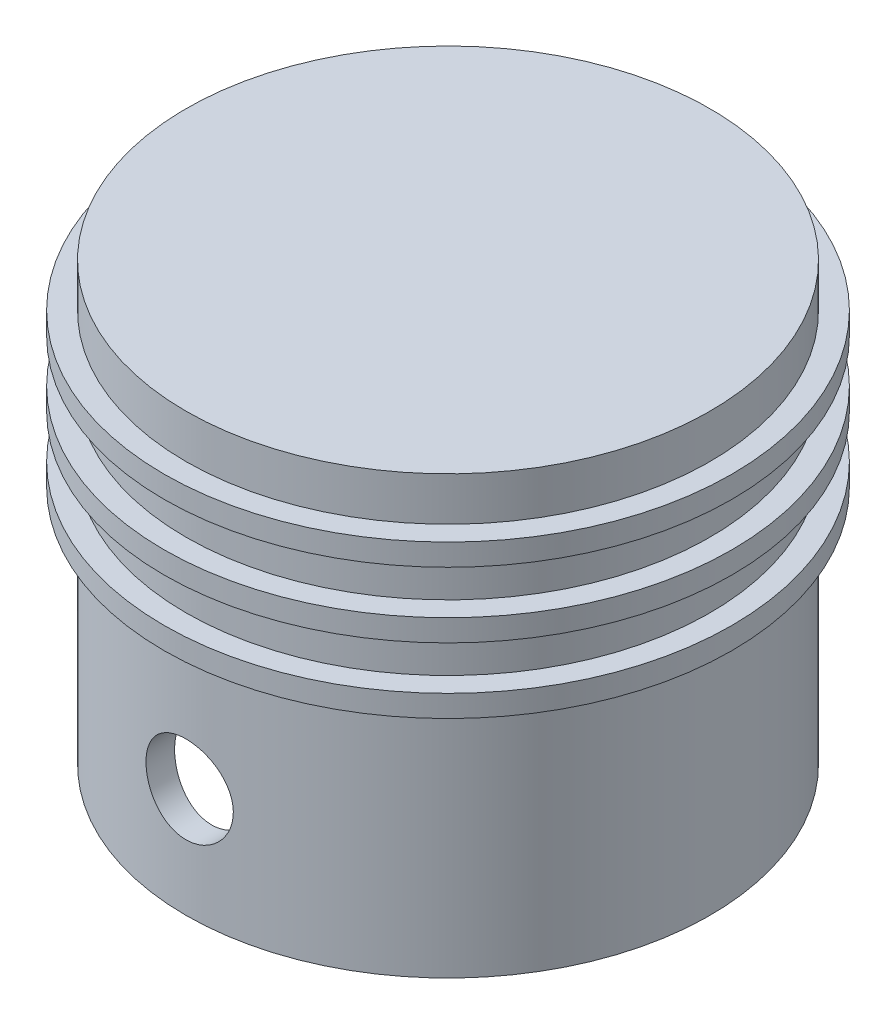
ISO-10303-21;
HEADER;
FILE_DESCRIPTION(('STEP AP214'),'2;1');
FILE_NAME('part.step','',(''),(''),'','','');
FILE_SCHEMA(('AUTOMOTIVE_DESIGN { 1 0 10303 214 1 1 1 1 }'));
ENDSEC;
DATA;
#1=APPLICATION_CONTEXT('core data for automotive mechanical design processes');
#2=APPLICATION_PROTOCOL_DEFINITION('international standard','automotive_design',2000,#1);
#3=PRODUCT_CONTEXT('',#1,'mechanical');
#4=PRODUCT('Part','Part','',(#3));
#5=PRODUCT_RELATED_PRODUCT_CATEGORY('part','',(#4));
#6=PRODUCT_DEFINITION_FORMATION('','',#4);
#7=PRODUCT_DEFINITION_CONTEXT('part definition',#1,'design');
#8=PRODUCT_DEFINITION('design','',#6,#7);
#9=PRODUCT_DEFINITION_SHAPE('','',#8);
#10=(LENGTH_UNIT() NAMED_UNIT(*) SI_UNIT(.MILLI.,.METRE.));
#11=(NAMED_UNIT(*) PLANE_ANGLE_UNIT() SI_UNIT($,.RADIAN.));
#12=(NAMED_UNIT(*) SI_UNIT($,.STERADIAN.) SOLID_ANGLE_UNIT());
#13=UNCERTAINTY_MEASURE_WITH_UNIT(LENGTH_MEASURE(1.E-05),#10,'distance_accuracy_value','');
#14=(GEOMETRIC_REPRESENTATION_CONTEXT(3) GLOBAL_UNCERTAINTY_ASSIGNED_CONTEXT((#13)) GLOBAL_UNIT_ASSIGNED_CONTEXT((#10,
#11,#12)) REPRESENTATION_CONTEXT('',''));
#15=CARTESIAN_POINT('',(0.,0.,0.));
#16=DIRECTION('',(0.,0.,1.));
#17=DIRECTION('',(1.,0.,0.));
#18=AXIS2_PLACEMENT_3D('',#15,#16,#17);
#19=CARTESIAN_POINT('',(-396.363758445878,-33.0570901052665,313.902522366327));
#20=DIRECTION('',(0.,1.,0.));
#21=DIRECTION('',(0.,0.,1.));
#22=AXIS2_PLACEMENT_3D('',#19,#20,#21);
#23=CYLINDRICAL_SURFACE('',#22,60.);
#24=CARTESIAN_POINT('',(-396.363758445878,-58.0570901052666,313.902522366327));
#25=DIRECTION('',(0.,1.,0.));
#26=DIRECTION('',(0.,0.,1.));
#27=AXIS2_PLACEMENT_3D('',#24,#25,#26);
#28=CIRCLE('',#27,60.);
#29=CARTESIAN_POINT('',(-396.363758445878,-58.0570901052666,373.902522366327));
#30=VERTEX_POINT('',#29);
#31=EDGE_CURVE('E39',#30,#30,#28,.T.);
#32=ORIENTED_EDGE('',*,*,#31,.T.);
#33=EDGE_LOOP('',(#32));
#34=FACE_BOUND('',#33,.T.);
#35=CARTESIAN_POINT('',(-396.363758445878,-48.0570901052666,313.902522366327));
#36=DIRECTION('',(0.,1.,0.));
#37=DIRECTION('',(0.,0.,1.));
#38=AXIS2_PLACEMENT_3D('',#35,#36,#37);
#39=CIRCLE('',#38,60.);
#40=CARTESIAN_POINT('',(-396.363758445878,-48.0570901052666,373.902522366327));
#41=VERTEX_POINT('',#40);
#42=EDGE_CURVE('E53',#41,#41,#39,.T.);
#43=ORIENTED_EDGE('',*,*,#42,.F.);
#44=EDGE_LOOP('',(#43));
#45=FACE_BOUND('',#44,.T.);
#46=ADVANCED_FACE('F13',(#34,#45),#23,.T.);
#47=CARTESIAN_POINT('',(-396.363758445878,-43.0570901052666,313.902522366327));
#48=DIRECTION('',(0.,1.,0.));
#49=DIRECTION('',(0.,0.,1.));
#50=AXIS2_PLACEMENT_3D('',#47,#48,#49);
#51=PLANE('',#50);
#52=CARTESIAN_POINT('',(-396.363758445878,-43.0570901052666,313.902522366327));
#53=DIRECTION('',(0.,1.,0.));
#54=DIRECTION('',(0.,0.,1.));
#55=AXIS2_PLACEMENT_3D('',#52,#53,#54);
#56=CIRCLE('',#55,65.);
#57=CARTESIAN_POINT('',(-396.363758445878,-43.0570901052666,378.902522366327));
#58=VERTEX_POINT('',#57);
#59=EDGE_CURVE('E46',#58,#58,#56,.T.);
#60=ORIENTED_EDGE('',*,*,#59,.T.);
#61=EDGE_LOOP('',(#60));
#62=FACE_BOUND('',#61,.T.);
#63=CARTESIAN_POINT('',(-396.363758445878,-43.0570901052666,313.902522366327));
#64=DIRECTION('',(0.,1.,0.));
#65=DIRECTION('',(0.,0.,1.));
#66=AXIS2_PLACEMENT_3D('',#63,#64,#65);
#67=CIRCLE('',#66,60.);
#68=CARTESIAN_POINT('',(-396.363758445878,-43.0570901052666,373.902522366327));
#69=VERTEX_POINT('',#68);
#70=EDGE_CURVE('E52',#69,#69,#67,.T.);
#71=ORIENTED_EDGE('',*,*,#70,.F.);
#72=EDGE_LOOP('',(#71));
#73=FACE_BOUND('',#72,.T.);
#74=ADVANCED_FACE('F123',(#62,#73),#51,.T.);
#75=CARTESIAN_POINT('',(-396.363758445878,-48.0570901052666,313.902522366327));
#76=DIRECTION('',(0.,1.,0.));
#77=DIRECTION('',(0.,0.,1.));
#78=AXIS2_PLACEMENT_3D('',#75,#76,#77);
#79=PLANE('',#78);
#80=CARTESIAN_POINT('',(-396.363758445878,-48.0570901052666,313.902522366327));
#81=DIRECTION('',(0.,1.,0.));
#82=DIRECTION('',(0.,0.,1.));
#83=AXIS2_PLACEMENT_3D('',#80,#81,#82);
#84=CIRCLE('',#83,65.);
#85=CARTESIAN_POINT('',(-396.363758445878,-48.0570901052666,378.902522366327));
#86=VERTEX_POINT('',#85);
#87=EDGE_CURVE('E49',#86,#86,#84,.T.);
#88=ORIENTED_EDGE('',*,*,#87,.F.);
#89=EDGE_LOOP('',(#88));
#90=FACE_BOUND('',#89,.T.);
#91=ORIENTED_EDGE('',*,*,#42,.T.);
#92=EDGE_LOOP('',(#91));
#93=FACE_BOUND('',#92,.T.);
#94=ADVANCED_FACE('F129',(#90,#93),#79,.F.);
#95=CARTESIAN_POINT('',(-396.363758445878,-48.0570901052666,313.902522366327));
#96=DIRECTION('',(0.,1.,0.));
#97=DIRECTION('',(0.,0.,1.));
#98=AXIS2_PLACEMENT_3D('',#95,#96,#97);
#99=CYLINDRICAL_SURFACE('',#98,65.);
#100=ORIENTED_EDGE('',*,*,#87,.T.);
#101=EDGE_LOOP('',(#100));
#102=FACE_BOUND('',#101,.T.);
#103=ORIENTED_EDGE('',*,*,#59,.F.);
#104=EDGE_LOOP('',(#103));
#105=FACE_BOUND('',#104,.T.);
#106=ADVANCED_FACE('F79',(#102,#105),#99,.T.);
#107=CARTESIAN_POINT('',(-396.363758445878,-33.0570901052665,313.902522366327));
#108=DIRECTION('',(0.,1.,0.));
#109=DIRECTION('',(0.,0.,1.));
#110=AXIS2_PLACEMENT_3D('',#107,#108,#109);
#111=PLANE('',#110);
#112=CARTESIAN_POINT('',(-396.363758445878,-33.0570901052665,313.902522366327));
#113=DIRECTION('',(0.,1.,0.));
#114=DIRECTION('',(0.,0.,1.));
#115=AXIS2_PLACEMENT_3D('',#112,#113,#114);
#116=CIRCLE('',#115,60.);
#117=CARTESIAN_POINT('',(-396.363758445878,-33.0570901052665,373.902522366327));
#118=VERTEX_POINT('',#117);
#119=EDGE_CURVE('E171',#118,#118,#116,.T.);
#120=ORIENTED_EDGE('',*,*,#119,.T.);
#121=EDGE_LOOP('',(#120));
#122=FACE_BOUND('',#121,.T.);
#123=ADVANCED_FACE('F81',(#122),#111,.T.);
#124=ORIENTED_EDGE('',*,*,#70,.T.);
#125=EDGE_LOOP('',(#124));
#126=FACE_BOUND('',#125,.T.);
#127=ORIENTED_EDGE('',*,*,#119,.F.);
#128=EDGE_LOOP('',(#127));
#129=FACE_BOUND('',#128,.T.);
#130=ADVANCED_FACE('F15',(#126,#129),#23,.T.);
#131=CARTESIAN_POINT('',(-396.363758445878,-63.0570901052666,313.902522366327));
#132=DIRECTION('',(0.,1.,0.));
#133=DIRECTION('',(0.,0.,1.));
#134=AXIS2_PLACEMENT_3D('',#131,#132,#133);
#135=PLANE('',#134);
#136=CARTESIAN_POINT('',(-396.363758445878,-63.0570901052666,313.902522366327));
#137=DIRECTION('',(0.,1.,0.));
#138=DIRECTION('',(0.,0.,1.));
#139=AXIS2_PLACEMENT_3D('',#136,#137,#138);
#140=CIRCLE('',#139,65.);
#141=CARTESIAN_POINT('',(-396.363758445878,-63.0570901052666,378.902522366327));
#142=VERTEX_POINT('',#141);
#143=EDGE_CURVE('E36',#142,#142,#140,.T.);
#144=ORIENTED_EDGE('',*,*,#143,.F.);
#145=EDGE_LOOP('',(#144));
#146=FACE_BOUND('',#145,.T.);
#147=CARTESIAN_POINT('',(-396.363758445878,-63.0570901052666,313.902522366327));
#148=DIRECTION('',(0.,1.,0.));
#149=DIRECTION('',(0.,0.,1.));
#150=AXIS2_PLACEMENT_3D('',#147,#148,#149);
#151=CIRCLE('',#150,60.);
#152=CARTESIAN_POINT('',(-396.363758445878,-63.0570901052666,373.902522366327));
#153=VERTEX_POINT('',#152);
#154=EDGE_CURVE('E28',#153,#153,#151,.T.);
#155=ORIENTED_EDGE('',*,*,#154,.T.);
#156=EDGE_LOOP('',(#155));
#157=FACE_BOUND('',#156,.T.);
#158=ADVANCED_FACE('F134',(#146,#157),#135,.F.);
#159=CARTESIAN_POINT('',(-396.363758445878,-58.0570901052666,313.902522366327));
#160=DIRECTION('',(0.,1.,0.));
#161=DIRECTION('',(0.,0.,1.));
#162=AXIS2_PLACEMENT_3D('',#159,#160,#161);
#163=PLANE('',#162);
#164=CARTESIAN_POINT('',(-396.363758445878,-58.0570901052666,313.902522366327));
#165=DIRECTION('',(0.,1.,0.));
#166=DIRECTION('',(0.,0.,1.));
#167=AXIS2_PLACEMENT_3D('',#164,#165,#166);
#168=CIRCLE('',#167,65.);
#169=CARTESIAN_POINT('',(-396.363758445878,-58.0570901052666,378.902522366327));
#170=VERTEX_POINT('',#169);
#171=EDGE_CURVE('E33',#170,#170,#168,.T.);
#172=ORIENTED_EDGE('',*,*,#171,.T.);
#173=EDGE_LOOP('',(#172));
#174=FACE_BOUND('',#173,.T.);
#175=ORIENTED_EDGE('',*,*,#31,.F.);
#176=EDGE_LOOP('',(#175));
#177=FACE_BOUND('',#176,.T.);
#178=ADVANCED_FACE('F147',(#174,#177),#163,.T.);
#179=CARTESIAN_POINT('',(-396.363758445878,-63.0570901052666,313.902522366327));
#180=DIRECTION('',(0.,1.,0.));
#181=DIRECTION('',(0.,0.,1.));
#182=AXIS2_PLACEMENT_3D('',#179,#180,#181);
#183=CYLINDRICAL_SURFACE('',#182,65.);
#184=ORIENTED_EDGE('',*,*,#143,.T.);
#185=EDGE_LOOP('',(#184));
#186=FACE_BOUND('',#185,.T.);
#187=ORIENTED_EDGE('',*,*,#171,.F.);
#188=EDGE_LOOP('',(#187));
#189=FACE_BOUND('',#188,.T.);
#190=ADVANCED_FACE('F138',(#186,#189),#183,.T.);
#191=CARTESIAN_POINT('',(-396.363758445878,-73.0570901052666,313.902522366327));
#192=DIRECTION('',(0.,1.,0.));
#193=DIRECTION('',(0.,0.,1.));
#194=AXIS2_PLACEMENT_3D('',#191,#192,#193);
#195=CIRCLE('',#194,60.);
#196=CARTESIAN_POINT('',(-396.363758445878,-73.0570901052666,373.902522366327));
#197=VERTEX_POINT('',#196);
#198=EDGE_CURVE('E31',#197,#197,#195,.T.);
#199=ORIENTED_EDGE('',*,*,#198,.T.);
#200=EDGE_LOOP('',(#199));
#201=FACE_BOUND('',#200,.T.);
#202=ORIENTED_EDGE('',*,*,#154,.F.);
#203=EDGE_LOOP('',(#202));
#204=FACE_BOUND('',#203,.T.);
#205=ADVANCED_FACE('F125',(#201,#204),#23,.T.);
#206=CARTESIAN_POINT('',(-396.363758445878,-78.0570901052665,313.902522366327));
#207=DIRECTION('',(0.,1.,0.));
#208=DIRECTION('',(0.,0.,1.));
#209=AXIS2_PLACEMENT_3D('',#206,#207,#208);
#210=PLANE('',#209);
#211=CARTESIAN_POINT('',(-396.363758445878,-78.0570901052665,313.902522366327));
#212=DIRECTION('',(0.,1.,0.));
#213=DIRECTION('',(0.,0.,1.));
#214=AXIS2_PLACEMENT_3D('',#211,#212,#213);
#215=CIRCLE('',#214,65.);
#216=CARTESIAN_POINT('',(-396.363758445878,-78.0570901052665,378.902522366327));
#217=VERTEX_POINT('',#216);
#218=EDGE_CURVE('E203',#217,#217,#215,.T.);
#219=ORIENTED_EDGE('',*,*,#218,.F.);
#220=EDGE_LOOP('',(#219));
#221=FACE_BOUND('',#220,.T.);
#222=CARTESIAN_POINT('',(-396.363758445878,-78.0570901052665,313.902522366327));
#223=DIRECTION('',(0.,1.,0.));
#224=DIRECTION('',(0.,0.,1.));
#225=AXIS2_PLACEMENT_3D('',#222,#223,#224);
#226=CIRCLE('',#225,60.);
#227=CARTESIAN_POINT('',(-396.363758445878,-78.0570901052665,373.902522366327));
#228=VERTEX_POINT('',#227);
#229=EDGE_CURVE('E8',#228,#228,#226,.T.);
#230=ORIENTED_EDGE('',*,*,#229,.T.);
#231=EDGE_LOOP('',(#230));
#232=FACE_BOUND('',#231,.T.);
#233=ADVANCED_FACE('F137',(#221,#232),#210,.F.);
#234=CARTESIAN_POINT('',(-396.363758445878,-73.0570901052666,313.902522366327));
#235=DIRECTION('',(0.,1.,0.));
#236=DIRECTION('',(0.,0.,1.));
#237=AXIS2_PLACEMENT_3D('',#234,#235,#236);
#238=PLANE('',#237);
#239=CARTESIAN_POINT('',(-396.363758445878,-73.0570901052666,313.902522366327));
#240=DIRECTION('',(0.,1.,0.));
#241=DIRECTION('',(0.,0.,1.));
#242=AXIS2_PLACEMENT_3D('',#239,#240,#241);
#243=CIRCLE('',#242,65.);
#244=CARTESIAN_POINT('',(-396.363758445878,-73.0570901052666,378.902522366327));
#245=VERTEX_POINT('',#244);
#246=EDGE_CURVE('E206',#245,#245,#243,.T.);
#247=ORIENTED_EDGE('',*,*,#246,.T.);
#248=EDGE_LOOP('',(#247));
#249=FACE_BOUND('',#248,.T.);
#250=ORIENTED_EDGE('',*,*,#198,.F.);
#251=EDGE_LOOP('',(#250));
#252=FACE_BOUND('',#251,.T.);
#253=ADVANCED_FACE('F117',(#249,#252),#238,.T.);
#254=CARTESIAN_POINT('',(-396.363758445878,-78.0570901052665,313.902522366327));
#255=DIRECTION('',(0.,1.,0.));
#256=DIRECTION('',(0.,0.,1.));
#257=AXIS2_PLACEMENT_3D('',#254,#255,#256);
#258=CYLINDRICAL_SURFACE('',#257,65.);
#259=ORIENTED_EDGE('',*,*,#218,.T.);
#260=EDGE_LOOP('',(#259));
#261=FACE_BOUND('',#260,.T.);
#262=ORIENTED_EDGE('',*,*,#246,.F.);
#263=EDGE_LOOP('',(#262));
#264=FACE_BOUND('',#263,.T.);
#265=ADVANCED_FACE('F111',(#261,#264),#258,.T.);
#266=CARTESIAN_POINT('',(-336.363758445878,-133.057090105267,313.902522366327));
#267=DIRECTION('',(0.,-1.,0.));
#268=DIRECTION('',(0.,0.,-1.));
#269=AXIS2_PLACEMENT_3D('',#266,#267,#268);
#270=PLANE('',#269);
#271=CARTESIAN_POINT('',(-396.363758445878,-133.057090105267,313.902522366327));
#272=DIRECTION('',(0.,1.,0.));
#273=DIRECTION('',(0.,0.,1.));
#274=AXIS2_PLACEMENT_3D('',#271,#272,#273);
#275=CIRCLE('',#274,55.);
#276=CARTESIAN_POINT('',(-396.363758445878,-133.057090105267,368.902522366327));
#277=VERTEX_POINT('',#276);
#278=EDGE_CURVE('E166',#277,#277,#275,.T.);
#279=ORIENTED_EDGE('',*,*,#278,.T.);
#280=EDGE_LOOP('',(#279));
#281=FACE_BOUND('',#280,.T.);
#282=CARTESIAN_POINT('',(-396.363758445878,-133.057090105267,313.902522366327));
#283=DIRECTION('',(0.,1.,0.));
#284=DIRECTION('',(0.,0.,1.));
#285=AXIS2_PLACEMENT_3D('',#282,#283,#284);
#286=CIRCLE('',#285,60.);
#287=CARTESIAN_POINT('',(-396.363758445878,-133.057090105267,373.902522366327));
#288=VERTEX_POINT('',#287);
#289=EDGE_CURVE('E56',#288,#288,#286,.T.);
#290=ORIENTED_EDGE('',*,*,#289,.F.);
#291=EDGE_LOOP('',(#290));
#292=FACE_BOUND('',#291,.T.);
#293=ADVANCED_FACE('F76',(#281,#292),#270,.T.);
#294=CARTESIAN_POINT('',(-396.363758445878,-108.057090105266,253.902522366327));
#295=DIRECTION('',(0.,0.,1.));
#296=DIRECTION('',(1.,0.,0.));
#297=AXIS2_PLACEMENT_3D('',#294,#295,#296);
#298=CYLINDRICAL_SURFACE('',#297,10.);
#299=CARTESIAN_POINT('',(-403.572572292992,-114.987674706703,367.355707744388));
#300=CARTESIAN_POINT('',(-403.768134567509,-114.784266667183,367.317260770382));
#301=CARTESIAN_POINT('',(-403.954999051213,-114.572660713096,367.278388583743));
#302=CARTESIAN_POINT('',(-404.310230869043,-114.134353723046,367.200592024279));
#303=CARTESIAN_POINT('',(-404.478594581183,-113.907649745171,367.16166764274));
#304=CARTESIAN_POINT('',(-404.79573356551,-113.440542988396,367.084560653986));
#305=CARTESIAN_POINT('',(-404.944492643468,-113.200129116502,367.046378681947));
#306=CARTESIAN_POINT('',(-405.221216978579,-112.70738731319,366.97157294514));
#307=CARTESIAN_POINT('',(-405.349182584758,-112.455059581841,366.934949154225));
#308=CARTESIAN_POINT('',(-405.583413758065,-111.940127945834,366.863985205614));
#309=CARTESIAN_POINT('',(-405.689673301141,-111.677521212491,366.829645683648));
#310=CARTESIAN_POINT('',(-405.879629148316,-111.143902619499,366.763929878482));
#311=CARTESIAN_POINT('',(-405.963325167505,-110.872890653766,366.732553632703));
#312=CARTESIAN_POINT('',(-406.107446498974,-110.324447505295,366.673356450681));
#313=CARTESIAN_POINT('',(-406.167878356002,-110.047018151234,366.645534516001));
#314=CARTESIAN_POINT('',(-406.264972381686,-109.487661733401,366.593915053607));
#315=CARTESIAN_POINT('',(-406.301634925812,-109.205734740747,366.570117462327));
#316=CARTESIAN_POINT('',(-406.350519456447,-108.643044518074,366.527179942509));
#317=CARTESIAN_POINT('',(-406.36304573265,-108.362311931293,366.507984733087));
#318=CARTESIAN_POINT('',(-406.364411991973,-107.800516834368,366.474086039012));
#319=CARTESIAN_POINT('',(-406.353252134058,-107.519454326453,366.459382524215));
#320=CARTESIAN_POINT('',(-406.307269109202,-106.959079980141,366.434553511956));
#321=CARTESIAN_POINT('',(-406.272446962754,-106.679768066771,366.424427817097));
#322=CARTESIAN_POINT('',(-406.179356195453,-106.124951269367,366.408703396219));
#323=CARTESIAN_POINT('',(-406.121087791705,-105.849446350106,366.403104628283));
#324=CARTESIAN_POINT('',(-405.982639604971,-105.308678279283,366.396305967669));
#325=CARTESIAN_POINT('',(-405.902828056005,-105.043321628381,366.395036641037));
#326=CARTESIAN_POINT('',(-405.721469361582,-104.520157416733,366.396410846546));
#327=CARTESIAN_POINT('',(-405.619922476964,-104.262349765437,366.399054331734));
#328=CARTESIAN_POINT('',(-405.395816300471,-103.756094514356,366.407858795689));
#329=CARTESIAN_POINT('',(-405.273256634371,-103.507647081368,366.414019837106));
#330=CARTESIAN_POINT('',(-405.007998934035,-103.021844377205,366.429375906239));
#331=CARTESIAN_POINT('',(-404.865300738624,-102.784489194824,366.438570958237));
#332=CARTESIAN_POINT('',(-404.560195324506,-102.321626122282,366.459481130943));
#333=CARTESIAN_POINT('',(-404.39771535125,-102.096166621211,366.47120568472));
#334=CARTESIAN_POINT('',(-404.054542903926,-101.659514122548,366.496548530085));
#335=CARTESIAN_POINT('',(-403.873842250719,-101.448327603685,366.510167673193));
#336=CARTESIAN_POINT('',(-403.495531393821,-101.041755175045,366.538652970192));
#337=CARTESIAN_POINT('',(-403.297920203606,-100.846370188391,366.553519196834));
#338=CARTESIAN_POINT('',(-402.88724483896,-100.472820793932,366.583835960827));
#339=CARTESIAN_POINT('',(-402.674187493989,-100.294648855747,366.599286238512));
#340=CARTESIAN_POINT('',(-402.231286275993,-99.9545580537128,366.630320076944));
#341=CARTESIAN_POINT('',(-402.001268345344,-99.792865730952,366.645902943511));
#342=CARTESIAN_POINT('',(-401.528403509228,-99.4893969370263,366.676367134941));
#343=CARTESIAN_POINT('',(-401.285556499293,-99.347620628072,366.691248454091));
#344=CARTESIAN_POINT('',(-400.788727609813,-99.0849888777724,366.719711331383));
#345=CARTESIAN_POINT('',(-400.534745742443,-98.9641334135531,366.733292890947));
#346=CARTESIAN_POINT('',(-400.017428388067,-98.7442124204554,366.758621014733));
#347=CARTESIAN_POINT('',(-399.754092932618,-98.6451468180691,366.770367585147));
#348=CARTESIAN_POINT('',(-399.219807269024,-98.4694887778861,366.791574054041));
#349=CARTESIAN_POINT('',(-398.948853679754,-98.3929064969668,366.801032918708));
#350=CARTESIAN_POINT('',(-398.401377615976,-98.2628433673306,366.817292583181));
#351=CARTESIAN_POINT('',(-398.124855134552,-98.2093625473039,366.824093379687));
#352=CARTESIAN_POINT('',(-397.568242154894,-98.125906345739,366.834776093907));
#353=CARTESIAN_POINT('',(-397.288151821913,-98.0959298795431,366.838658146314));
#354=CARTESIAN_POINT('',(-396.726416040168,-98.0597057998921,366.843355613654));
#355=CARTESIAN_POINT('',(-396.444770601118,-98.0534580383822,366.844171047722));
#356=CARTESIAN_POINT('',(-395.884129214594,-98.0646948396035,366.842709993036));
#357=CARTESIAN_POINT('',(-395.605129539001,-98.0819973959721,366.840457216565));
#358=CARTESIAN_POINT('',(-395.049597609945,-98.1398842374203,366.832986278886));
#359=CARTESIAN_POINT('',(-394.773065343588,-98.180468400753,366.827768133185));
#360=CARTESIAN_POINT('',(-394.22442960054,-98.2846167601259,366.814562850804));
#361=CARTESIAN_POINT('',(-393.952326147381,-98.3481810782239,366.806575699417));
#362=CARTESIAN_POINT('',(-393.414467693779,-98.497822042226,366.78813440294));
#363=CARTESIAN_POINT('',(-393.148712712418,-98.5838987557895,366.777680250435));
#364=CARTESIAN_POINT('',(-392.625378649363,-98.7779516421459,366.754701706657));
#365=CARTESIAN_POINT('',(-392.367800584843,-98.8859305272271,366.742177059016));
#366=CARTESIAN_POINT('',(-391.862554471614,-99.1230504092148,366.715536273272));
#367=CARTESIAN_POINT('',(-391.614889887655,-99.2521987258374,366.70141958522));
#368=CARTESIAN_POINT('',(-391.131301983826,-99.530704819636,366.672152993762));
#369=CARTESIAN_POINT('',(-390.895377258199,-99.6800601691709,366.657003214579));
#370=CARTESIAN_POINT('',(-390.436856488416,-99.9979549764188,366.626275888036));
#371=CARTESIAN_POINT('',(-390.214260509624,-100.166494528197,366.61069833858));
#372=CARTESIAN_POINT('',(-389.782221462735,-100.523005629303,366.5796369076));
#373=CARTESIAN_POINT('',(-389.572896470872,-100.711120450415,366.564154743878));
#374=CARTESIAN_POINT('',(-389.170877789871,-101.104285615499,366.534093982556));
#375=CARTESIAN_POINT('',(-388.978178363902,-101.309330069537,366.519515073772));
#376=CARTESIAN_POINT('',(-388.610658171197,-101.735023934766,366.491929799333));
#377=CARTESIAN_POINT('',(-388.435840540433,-101.955676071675,366.478923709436));
#378=CARTESIAN_POINT('',(-388.105373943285,-102.411010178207,366.455143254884));
#379=CARTESIAN_POINT('',(-387.949724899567,-102.645692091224,366.444368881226));
#380=CARTESIAN_POINT('',(-387.658882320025,-103.127166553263,366.425675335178));
#381=CARTESIAN_POINT('',(-387.523666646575,-103.373945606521,366.417753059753));
#382=CARTESIAN_POINT('',(-387.274477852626,-103.878090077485,366.405294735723));
#383=CARTESIAN_POINT('',(-387.160504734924,-104.135455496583,366.400758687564));
#384=CARTESIAN_POINT('',(-386.954650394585,-104.658889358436,366.395536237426));
#385=CARTESIAN_POINT('',(-386.862767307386,-104.924957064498,366.394849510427));
#386=CARTESIAN_POINT('',(-386.701756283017,-105.463868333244,366.397685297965));
#387=CARTESIAN_POINT('',(-386.632628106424,-105.736711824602,366.401207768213));
#388=CARTESIAN_POINT('',(-386.518327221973,-106.28378432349,366.412633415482));
#389=CARTESIAN_POINT('',(-386.472871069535,-106.557955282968,366.420482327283));
#390=CARTESIAN_POINT('',(-386.404937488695,-107.108965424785,366.440632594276));
#391=CARTESIAN_POINT('',(-386.382459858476,-107.385804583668,366.452933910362));
#392=CARTESIAN_POINT('',(-386.36059546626,-107.940152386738,366.481970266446));
#393=CARTESIAN_POINT('',(-386.361208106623,-108.217661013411,366.498705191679));
#394=CARTESIAN_POINT('',(-386.385452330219,-108.771376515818,366.536462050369));
#395=CARTESIAN_POINT('',(-386.4090839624,-109.047583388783,366.557483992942));
#396=CARTESIAN_POINT('',(-386.479018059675,-109.595948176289,366.603476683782));
#397=CARTESIAN_POINT('',(-386.525253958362,-109.86811557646,366.628435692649));
#398=CARTESIAN_POINT('',(-386.639961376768,-110.407357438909,366.681964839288));
#399=CARTESIAN_POINT('',(-386.708432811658,-110.674431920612,366.710534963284));
#400=CARTESIAN_POINT('',(-386.867053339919,-111.201667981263,366.770801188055));
#401=CARTESIAN_POINT('',(-386.957200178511,-111.461830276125,366.802496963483));
#402=CARTESIAN_POINT('',(-387.158533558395,-111.973656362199,366.868461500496));
#403=CARTESIAN_POINT('',(-387.269728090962,-112.225316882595,366.902731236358));
#404=CARTESIAN_POINT('',(-387.51432868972,-112.722450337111,366.973772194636));
#405=CARTESIAN_POINT('',(-387.648068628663,-112.967754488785,367.010575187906));
#406=CARTESIAN_POINT('',(-387.935561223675,-113.446286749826,367.085458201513));
#407=CARTESIAN_POINT('',(-388.089322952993,-113.679509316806,367.123538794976));
#408=CARTESIAN_POINT('',(-388.415784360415,-114.132253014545,367.200196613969));
#409=CARTESIAN_POINT('',(-388.588486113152,-114.351772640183,367.238773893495));
#410=CARTESIAN_POINT('',(-388.951587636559,-114.77553827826,367.315611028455));
#411=CARTESIAN_POINT('',(-389.141979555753,-114.979790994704,367.353871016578));
#412=CARTESIAN_POINT('',(-389.542550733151,-115.374984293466,367.429912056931));
#413=CARTESIAN_POINT('',(-389.753003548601,-115.565651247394,367.467674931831));
#414=CARTESIAN_POINT('',(-390.189483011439,-115.928483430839,367.541222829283));
#415=CARTESIAN_POINT('',(-390.415503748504,-116.100655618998,367.577008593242));
#416=CARTESIAN_POINT('',(-390.88170220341,-116.425349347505,367.645824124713));
#417=CARTESIAN_POINT('',(-391.121882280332,-116.577867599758,367.678853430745));
#418=CARTESIAN_POINT('',(-391.614711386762,-116.862057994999,367.741396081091));
#419=CARTESIAN_POINT('',(-391.867360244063,-116.993730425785,367.770909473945));
#420=CARTESIAN_POINT('',(-392.381000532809,-117.23408879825,367.825484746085));
#421=CARTESIAN_POINT('',(-392.641895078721,-117.342973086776,367.850584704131));
#422=CARTESIAN_POINT('',(-393.17233374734,-117.53837121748,367.896074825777));
#423=CARTESIAN_POINT('',(-393.441877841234,-117.624885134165,367.916465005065));
#424=CARTESIAN_POINT('',(-393.987605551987,-117.774803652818,367.952049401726));
#425=CARTESIAN_POINT('',(-394.263788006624,-117.838212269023,367.967244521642));
#426=CARTESIAN_POINT('',(-394.820778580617,-117.941392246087,367.992078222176));
#427=CARTESIAN_POINT('',(-395.101586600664,-117.981164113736,368.001716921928));
#428=CARTESIAN_POINT('',(-395.658479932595,-118.036010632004,368.015031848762));
#429=CARTESIAN_POINT('',(-395.934502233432,-118.051691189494,368.018854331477));
#430=CARTESIAN_POINT('',(-396.486916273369,-118.060146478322,368.020913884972));
#431=CARTESIAN_POINT('',(-396.763308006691,-118.052921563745,368.019151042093));
#432=CARTESIAN_POINT('',(-397.314481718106,-118.015625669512,368.010080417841));
#433=CARTESIAN_POINT('',(-397.589263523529,-117.985552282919,368.002772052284));
#434=CARTESIAN_POINT('',(-398.135201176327,-117.902810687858,367.982778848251));
#435=CARTESIAN_POINT('',(-398.406357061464,-117.850142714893,367.970094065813));
#436=CARTESIAN_POINT('',(-398.940546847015,-117.723258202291,367.939784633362));
#437=CARTESIAN_POINT('',(-399.203633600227,-117.649252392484,367.922208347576));
#438=CARTESIAN_POINT('',(-399.722560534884,-117.480090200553,367.882457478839));
#439=CARTESIAN_POINT('',(-399.978400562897,-117.384933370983,367.860282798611));
#440=CARTESIAN_POINT('',(-400.480961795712,-117.174261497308,367.811834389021));
#441=CARTESIAN_POINT('',(-400.727688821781,-117.058759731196,367.785563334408));
#442=CARTESIAN_POINT('',(-401.210525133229,-116.808252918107,367.729485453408));
#443=CARTESIAN_POINT('',(-401.446636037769,-116.673250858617,367.699679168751));
#444=CARTESIAN_POINT('',(-402.023052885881,-116.31174611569,367.621347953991));
#445=CARTESIAN_POINT('',(-402.355799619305,-116.073452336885,367.570968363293));
#446=CARTESIAN_POINT('',(-402.989275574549,-115.558370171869,367.465924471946));
#447=CARTESIAN_POINT('',(-403.290003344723,-115.281580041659,367.411259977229));
#448=CARTESIAN_POINT('',(-403.572572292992,-114.987674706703,367.355707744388));
#449=B_SPLINE_CURVE_WITH_KNOTS('',3,(#299,#300,#301,#302,#303,#304,#305,#306,#307,#308,#309,
#310,#311,#312,#313,#314,#315,#316,#317,#318,#319,#320,#321,#322,#323,#324,#325,#326,#327,#328,
#329,#330,#331,#332,#333,#334,#335,#336,#337,#338,#339,#340,#341,#342,#343,#344,#345,#346,#347,
#348,#349,#350,#351,#352,#353,#354,#355,#356,#357,#358,#359,#360,#361,#362,#363,#364,#365,#366,
#367,#368,#369,#370,#371,#372,#373,#374,#375,#376,#377,#378,#379,#380,#381,#382,#383,#384,#385,
#386,#387,#388,#389,#390,#391,#392,#393,#394,#395,#396,#397,#398,#399,#400,#401,#402,#403,#404,
#405,#406,#407,#408,#409,#410,#411,#412,#413,#414,#415,#416,#417,#418,#419,#420,#421,#422,#423,
#424,#425,#426,#427,#428,#429,#430,#431,#432,#433,#434,#435,#436,#437,#438,#439,#440,#441,#442,
#443,#444,#445,#446,#447,#448),.UNSPECIFIED.,.T.,.F.,(4,2,2,2,2,2,2,2,2,2,2,2,2,2,2,2,2,2,2,2,2,
2,2,2,2,2,2,2,2,2,2,2,2,2,2,2,2,2,2,2,2,2,2,2,2,2,2,2,2,2,2,2,2,2,2,2,2,2,2,2,2,2,2,2,2,2,2,2,2,
2,2,2,2,2,4),(0.,0.853976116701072,1.70811912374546,2.56296332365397,3.41779317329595,
4.2728599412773,5.12793750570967,5.98277434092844,6.83759767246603,7.68157173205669,
8.52554012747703,9.36947212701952,10.2133963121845,11.0437206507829,11.8740350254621,
12.7043641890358,13.5346999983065,14.3681875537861,15.2020509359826,16.0359629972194,
16.8695085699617,17.7132935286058,18.5570853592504,19.4008762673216,20.244664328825,
21.0888329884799,21.9330026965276,22.7771334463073,23.6212589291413,24.458897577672,
25.2965318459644,26.1341705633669,26.9718117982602,27.8095568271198,28.6475921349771,
29.4855268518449,30.3234656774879,31.1680380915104,32.0123179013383,32.8567455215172,
33.7011697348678,34.5446724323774,35.3881752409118,36.2316068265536,37.0750295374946,
37.9081065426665,38.7411762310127,39.5742243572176,40.4072742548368,41.2378855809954,
42.068493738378,42.8990155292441,43.7298532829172,44.5742948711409,45.4191204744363,
46.2640387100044,47.108583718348,47.9669950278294,48.8250822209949,49.6833127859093,
50.5415315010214,51.3919373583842,52.2423403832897,53.092595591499,53.9428325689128,
54.7713138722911,55.5997823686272,56.4283381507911,57.2568852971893,58.0775147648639,
58.89816159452,59.718274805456,60.5382625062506,61.7721211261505,63.0060356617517),.UNSPECIFIED.);
#450=CARTESIAN_POINT('',(-403.572572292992,-114.987674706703,367.355707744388));
#451=VERTEX_POINT('',#450);
#452=EDGE_CURVE('E86',#451,#451,#449,.T.);
#453=ORIENTED_EDGE('',*,*,#452,.T.);
#454=EDGE_LOOP('',(#453));
#455=FACE_BOUND('',#454,.T.);
#456=CARTESIAN_POINT('',(-396.363758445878,-118.057090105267,373.902522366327));
#457=CARTESIAN_POINT('',(-396.64263590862,-118.057094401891,373.902524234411));
#458=CARTESIAN_POINT('',(-396.921455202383,-118.045420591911,373.900574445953));
#459=CARTESIAN_POINT('',(-397.477176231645,-117.99882174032,373.892833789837));
#460=CARTESIAN_POINT('',(-397.754077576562,-117.963892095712,373.887042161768));
#461=CARTESIAN_POINT('',(-398.304107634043,-117.871004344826,373.871771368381));
#462=CARTESIAN_POINT('',(-398.577233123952,-117.813027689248,373.8622892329));
#463=CARTESIAN_POINT('',(-399.117556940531,-117.674489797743,373.839903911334));
#464=CARTESIAN_POINT('',(-399.384755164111,-117.59392816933,373.827000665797));
#465=CARTESIAN_POINT('',(-399.911116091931,-117.410903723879,373.798145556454));
#466=CARTESIAN_POINT('',(-400.170285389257,-117.30845945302,373.782196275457));
#467=CARTESIAN_POINT('',(-400.679032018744,-117.082382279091,373.74768446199));
#468=CARTESIAN_POINT('',(-400.928609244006,-116.958749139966,373.729121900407));
#469=CARTESIAN_POINT('',(-401.416388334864,-116.691224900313,373.689902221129));
#470=CARTESIAN_POINT('',(-401.654593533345,-116.547339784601,373.669245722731));
#471=CARTESIAN_POINT('',(-402.118170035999,-116.240248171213,373.626394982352));
#472=CARTESIAN_POINT('',(-402.343537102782,-116.07703534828,373.60420023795));
#473=CARTESIAN_POINT('',(-402.781669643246,-115.731006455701,373.558698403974));
#474=CARTESIAN_POINT('',(-402.994313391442,-115.54803726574,373.535383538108));
#475=CARTESIAN_POINT('',(-403.403468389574,-115.164905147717,373.488467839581));
#476=CARTESIAN_POINT('',(-403.59997956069,-114.96474213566,373.464867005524));
#477=CARTESIAN_POINT('',(-403.975563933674,-114.548546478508,373.418035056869));
#478=CARTESIAN_POINT('',(-404.154632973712,-114.332510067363,373.394804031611));
#479=CARTESIAN_POINT('',(-404.493976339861,-113.886165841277,373.349379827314));
#480=CARTESIAN_POINT('',(-404.654257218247,-113.655863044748,373.32718628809));
#481=CARTESIAN_POINT('',(-404.955922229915,-113.18098978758,373.284321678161));
#482=CARTESIAN_POINT('',(-405.097179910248,-112.936338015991,373.263661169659));
#483=CARTESIAN_POINT('',(-405.358560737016,-112.4358161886,373.224617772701));
#484=CARTESIAN_POINT('',(-405.478683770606,-112.179946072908,373.206234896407));
#485=CARTESIAN_POINT('',(-405.696893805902,-111.658809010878,373.172285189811));
#486=CARTESIAN_POINT('',(-405.794981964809,-111.393542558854,373.156718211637));
#487=CARTESIAN_POINT('',(-405.968381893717,-110.855499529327,373.128858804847));
#488=CARTESIAN_POINT('',(-406.043693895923,-110.582723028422,373.116566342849));
#489=CARTESIAN_POINT('',(-406.170371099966,-110.034173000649,373.095718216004));
#490=CARTESIAN_POINT('',(-406.221950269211,-109.758450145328,373.087129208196));
#491=CARTESIAN_POINT('',(-406.301775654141,-109.203555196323,373.073777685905));
#492=CARTESIAN_POINT('',(-406.330021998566,-108.924383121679,373.069015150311));
#493=CARTESIAN_POINT('',(-406.362959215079,-108.364630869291,373.063457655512));
#494=CARTESIAN_POINT('',(-406.36765155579,-108.08405078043,373.062662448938));
#495=CARTESIAN_POINT('',(-406.353447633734,-107.523506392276,373.065062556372));
#496=CARTESIAN_POINT('',(-406.334551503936,-107.24354208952,373.068257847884));
#497=CARTESIAN_POINT('',(-406.273636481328,-106.689142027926,373.078490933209));
#498=CARTESIAN_POINT('',(-406.231858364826,-106.414679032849,373.085488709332));
#499=CARTESIAN_POINT('',(-406.125664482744,-105.870288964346,373.103097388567));
#500=CARTESIAN_POINT('',(-406.06124889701,-105.600361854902,373.113708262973));
#501=CARTESIAN_POINT('',(-405.910263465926,-105.066925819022,373.138238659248));
#502=CARTESIAN_POINT('',(-405.823693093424,-104.803417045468,373.152158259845));
#503=CARTESIAN_POINT('',(-405.629038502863,-104.28464515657,373.182909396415));
#504=CARTESIAN_POINT('',(-405.520954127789,-104.029382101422,373.199740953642));
#505=CARTESIAN_POINT('',(-405.283507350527,-103.527691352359,373.235924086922));
#506=CARTESIAN_POINT('',(-405.154049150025,-103.281309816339,373.255286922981));
#507=CARTESIAN_POINT('',(-404.875082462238,-102.800217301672,373.29593302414));
#508=CARTESIAN_POINT('',(-404.725566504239,-102.565510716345,373.317217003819));
#509=CARTESIAN_POINT('',(-404.407622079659,-102.10952895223,373.361096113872));
#510=CARTESIAN_POINT('',(-404.239200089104,-101.88824921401,373.383690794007));
#511=CARTESIAN_POINT('',(-403.884479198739,-101.460423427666,373.429581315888));
#512=CARTESIAN_POINT('',(-403.698172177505,-101.25388414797,373.45287747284));
#513=CARTESIAN_POINT('',(-403.306592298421,-100.854575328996,373.499807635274));
#514=CARTESIAN_POINT('',(-403.101112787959,-100.66200845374,373.523442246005));
#515=CARTESIAN_POINT('',(-402.674705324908,-100.29493469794,373.570084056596));
#516=CARTESIAN_POINT('',(-402.453784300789,-100.1204198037,373.593091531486));
#517=CARTESIAN_POINT('',(-401.997834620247,-99.7905066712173,373.637852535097));
#518=CARTESIAN_POINT('',(-401.762799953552,-99.6351166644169,373.659605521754));
#519=CARTESIAN_POINT('',(-401.280427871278,-99.344708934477,373.701225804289));
#520=CARTESIAN_POINT('',(-401.033095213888,-99.209683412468,373.721093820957));
#521=CARTESIAN_POINT('',(-400.527504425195,-98.9607890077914,373.758412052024));
#522=CARTESIAN_POINT('',(-400.269235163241,-98.8469423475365,373.775859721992));
#523=CARTESIAN_POINT('',(-399.743838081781,-98.6414313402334,373.807816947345));
#524=CARTESIAN_POINT('',(-399.476710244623,-98.5497670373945,373.822326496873));
#525=CARTESIAN_POINT('',(-398.935528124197,-98.3893266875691,373.847992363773));
#526=CARTESIAN_POINT('',(-398.661474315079,-98.3205490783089,373.85914891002));
#527=CARTESIAN_POINT('',(-398.108410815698,-98.2064093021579,373.877790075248));
#528=CARTESIAN_POINT('',(-397.829401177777,-98.1610468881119,373.885274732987));
#529=CARTESIAN_POINT('',(-397.271766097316,-98.094487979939,373.896291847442));
#530=CARTESIAN_POINT('',(-396.993174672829,-98.0730137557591,373.899869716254));
#531=CARTESIAN_POINT('',(-396.435150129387,-98.0534485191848,373.903128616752));
#532=CARTESIAN_POINT('',(-396.155717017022,-98.0553573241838,373.902809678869));
#533=CARTESIAN_POINT('',(-395.598032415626,-98.0825425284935,373.898284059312));
#534=CARTESIAN_POINT('',(-395.319780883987,-98.1078180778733,373.894077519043));
#535=CARTESIAN_POINT('',(-394.766448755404,-98.1815392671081,373.881895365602));
#536=CARTESIAN_POINT('',(-394.491368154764,-98.2299848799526,373.873919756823));
#537=CARTESIAN_POINT('',(-393.9479959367,-98.3493099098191,373.854482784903));
#538=CARTESIAN_POINT('',(-393.679673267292,-98.4200515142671,373.843042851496));
#539=CARTESIAN_POINT('',(-393.149974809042,-98.5835257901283,373.81697734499));
#540=CARTESIAN_POINT('',(-392.888598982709,-98.6762583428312,373.802351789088));
#541=CARTESIAN_POINT('',(-392.374632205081,-98.8830185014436,373.770319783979));
#542=CARTESIAN_POINT('',(-392.122040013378,-98.9970430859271,373.752913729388));
#543=CARTESIAN_POINT('',(-391.627227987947,-99.2456221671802,373.715789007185));
#544=CARTESIAN_POINT('',(-391.385012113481,-99.380184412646,373.696069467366));
#545=CARTESIAN_POINT('',(-390.910694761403,-99.6700764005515,373.654687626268));
#546=CARTESIAN_POINT('',(-390.678695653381,-99.8255715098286,373.633010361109));
#547=CARTESIAN_POINT('',(-390.228482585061,-100.155425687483,373.588446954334));
#548=CARTESIAN_POINT('',(-390.010274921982,-100.329793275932,373.565560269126));
#549=CARTESIAN_POINT('',(-389.589223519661,-100.696142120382,373.519219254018));
#550=CARTESIAN_POINT('',(-389.386380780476,-100.888124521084,373.4957648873));
#551=CARTESIAN_POINT('',(-388.997539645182,-101.288292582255,373.448950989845));
#552=CARTESIAN_POINT('',(-388.811533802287,-101.496471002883,373.425591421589));
#553=CARTESIAN_POINT('',(-388.455624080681,-101.9300258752,373.379357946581));
#554=CARTESIAN_POINT('',(-388.285915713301,-102.155563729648,373.35649200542));
#555=CARTESIAN_POINT('',(-387.966167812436,-102.620182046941,373.312172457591));
#556=CARTESIAN_POINT('',(-387.816120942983,-102.859257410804,373.290718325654));
#557=CARTESIAN_POINT('',(-387.536679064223,-103.349408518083,373.249827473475));
#558=CARTESIAN_POINT('',(-387.407287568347,-103.600486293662,373.230391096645));
#559=CARTESIAN_POINT('',(-387.170142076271,-104.112840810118,373.194105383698));
#560=CARTESIAN_POINT('',(-387.062387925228,-104.374117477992,373.177256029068));
#561=CARTESIAN_POINT('',(-386.869730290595,-104.903909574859,373.146702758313));
#562=CARTESIAN_POINT('',(-386.784733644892,-105.172390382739,373.132986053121));
#563=CARTESIAN_POINT('',(-386.637652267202,-105.71570928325,373.109012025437));
#564=CARTESIAN_POINT('',(-386.575567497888,-105.990547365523,373.098754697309));
#565=CARTESIAN_POINT('',(-386.474796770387,-106.544573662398,373.082004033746));
#566=CARTESIAN_POINT('',(-386.436109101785,-106.823761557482,373.075510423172));
#567=CARTESIAN_POINT('',(-386.38243102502,-107.384468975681,373.066479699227));
#568=CARTESIAN_POINT('',(-386.367440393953,-107.665988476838,373.06394254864));
#569=CARTESIAN_POINT('',(-386.361312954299,-108.225775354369,373.062906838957));
#570=CARTESIAN_POINT('',(-386.369880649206,-108.504039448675,373.064358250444));
#571=CARTESIAN_POINT('',(-386.410173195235,-109.058836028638,373.071150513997));
#572=CARTESIAN_POINT('',(-386.441897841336,-109.335368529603,373.076491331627));
#573=CARTESIAN_POINT('',(-386.528259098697,-109.884729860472,373.090906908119));
#574=CARTESIAN_POINT('',(-386.582895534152,-110.157558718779,373.099981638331));
#575=CARTESIAN_POINT('',(-386.714664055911,-110.697587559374,373.121602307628));
#576=CARTESIAN_POINT('',(-386.791796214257,-110.964787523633,373.13414825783));
#577=CARTESIAN_POINT('',(-386.96785896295,-111.491334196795,373.162331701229));
#578=CARTESIAN_POINT('',(-387.066760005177,-111.750691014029,373.177965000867));
#579=CARTESIAN_POINT('',(-387.285734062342,-112.260231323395,373.211895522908));
#580=CARTESIAN_POINT('',(-387.405814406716,-112.510411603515,373.230193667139));
#581=CARTESIAN_POINT('',(-387.666244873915,-112.999768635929,373.268931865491));
#582=CARTESIAN_POINT('',(-387.806592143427,-113.238946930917,373.28937161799));
#583=CARTESIAN_POINT('',(-388.106586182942,-113.70473089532,373.331825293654));
#584=CARTESIAN_POINT('',(-388.26623318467,-113.931336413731,373.353839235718));
#585=CARTESIAN_POINT('',(-388.605760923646,-114.373102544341,373.399103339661));
#586=CARTESIAN_POINT('',(-388.785861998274,-114.588092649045,373.422365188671));
#587=CARTESIAN_POINT('',(-389.16339809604,-115.002107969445,373.469215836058));
#588=CARTESIAN_POINT('',(-389.360827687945,-115.201138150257,373.492804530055));
#589=CARTESIAN_POINT('',(-389.771797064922,-115.58201979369,373.539665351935));
#590=CARTESIAN_POINT('',(-389.985343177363,-115.763864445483,373.562937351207));
#591=CARTESIAN_POINT('',(-390.427014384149,-116.109022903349,373.608504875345));
#592=CARTESIAN_POINT('',(-390.655139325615,-116.272336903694,373.630800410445));
#593=CARTESIAN_POINT('',(-391.126040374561,-116.580352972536,373.673941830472));
#594=CARTESIAN_POINT('',(-391.368907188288,-116.724917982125,373.694776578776));
#595=CARTESIAN_POINT('',(-391.866138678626,-116.993040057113,373.734233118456));
#596=CARTESIAN_POINT('',(-392.120503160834,-117.116597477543,373.752854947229));
#597=CARTESIAN_POINT('',(-392.638722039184,-117.341691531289,373.787340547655));
#598=CARTESIAN_POINT('',(-392.902567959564,-117.44324728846,373.803206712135));
#599=CARTESIAN_POINT('',(-393.437978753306,-117.623679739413,373.831745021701));
#600=CARTESIAN_POINT('',(-393.709541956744,-117.70256129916,373.844417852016));
#601=CARTESIAN_POINT('',(-394.372774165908,-117.865046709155,373.870738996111));
#602=CARTESIAN_POINT('',(-394.767434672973,-117.936977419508,373.882602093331));
#603=CARTESIAN_POINT('',(-395.562689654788,-118.032995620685,373.898492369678));
#604=CARTESIAN_POINT('',(-395.963284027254,-118.057083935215,373.902519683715));
#605=CARTESIAN_POINT('',(-396.363758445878,-118.057090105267,373.902522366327));
#606=B_SPLINE_CURVE_WITH_KNOTS('',3,(#456,#457,#458,#459,#460,#461,#462,#463,#464,#465,#466,
#467,#468,#469,#470,#471,#472,#473,#474,#475,#476,#477,#478,#479,#480,#481,#482,#483,#484,#485,
#486,#487,#488,#489,#490,#491,#492,#493,#494,#495,#496,#497,#498,#499,#500,#501,#502,#503,#504,
#505,#506,#507,#508,#509,#510,#511,#512,#513,#514,#515,#516,#517,#518,#519,#520,#521,#522,#523,
#524,#525,#526,#527,#528,#529,#530,#531,#532,#533,#534,#535,#536,#537,#538,#539,#540,#541,#542,
#543,#544,#545,#546,#547,#548,#549,#550,#551,#552,#553,#554,#555,#556,#557,#558,#559,#560,#561,
#562,#563,#564,#565,#566,#567,#568,#569,#570,#571,#572,#573,#574,#575,#576,#577,#578,#579,#580,
#581,#582,#583,#584,#585,#586,#587,#588,#589,#590,#591,#592,#593,#594,#595,#596,#597,#598,#599,
#600,#601,#602,#603,#604,#605),.UNSPECIFIED.,.T.,.F.,(4,2,2,2,2,2,2,2,2,2,2,2,2,2,2,2,2,2,2,2,2,
2,2,2,2,2,2,2,2,2,2,2,2,2,2,2,2,2,2,2,2,2,2,2,2,2,2,2,2,2,2,2,2,2,2,2,2,2,2,2,2,2,2,2,2,2,2,2,2,
2,2,2,2,2,4),(0.,0.836281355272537,1.67272828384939,2.50984979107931,3.34698584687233,
4.18341520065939,5.01985387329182,5.85604588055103,6.69251230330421,7.53600352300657,
8.37949886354,9.22319497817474,10.0665959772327,10.915352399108,11.7641133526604,
12.6128297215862,13.4615374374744,14.3024358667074,15.1433296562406,15.9841710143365,
16.8250076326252,17.6571619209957,18.4893095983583,19.3214770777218,20.1536506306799,
20.9896606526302,21.8259829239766,22.6620195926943,23.4984377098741,24.3452345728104,
25.1916538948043,26.0384362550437,26.8848934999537,27.7322339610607,28.5795761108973,
29.4268604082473,30.2741357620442,31.1114540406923,31.9487657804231,32.786047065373,
33.6233273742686,34.4555306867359,35.2877295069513,36.1198103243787,36.9522058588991,
37.7916121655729,38.6313990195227,39.4712404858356,40.3107086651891,41.1592395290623,
42.0074528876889,42.8558103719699,43.7041617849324,44.5489852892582,45.3938074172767,
46.238567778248,47.0833201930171,47.9175252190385,48.7517228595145,49.5859140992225,
50.4201080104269,51.2531765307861,52.0865339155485,52.919774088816,53.7530242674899,
54.596299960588,55.4393122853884,56.2826573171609,57.1259935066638,57.9751835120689,
58.8243591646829,59.6727937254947,60.5210460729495,61.7219859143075,62.9229050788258),.UNSPECIFIED.);
#607=CARTESIAN_POINT('',(-396.363758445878,-118.057090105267,373.902522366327));
#608=VERTEX_POINT('',#607);
#609=EDGE_CURVE('E64',#608,#608,#606,.T.);
#610=ORIENTED_EDGE('',*,*,#609,.F.);
#611=EDGE_LOOP('',(#610));
#612=FACE_BOUND('',#611,.T.);
#613=ADVANCED_FACE('F70',(#455,#612),#298,.F.);
#614=CARTESIAN_POINT('',(-386.363758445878,-108.057090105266,254.74172453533));
#615=CARTESIAN_POINT('',(-386.363754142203,-107.778242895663,254.741726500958));
#616=CARTESIAN_POINT('',(-386.375425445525,-107.499453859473,254.739749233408));
#617=CARTESIAN_POINT('',(-386.422014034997,-106.943794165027,254.731902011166));
#618=CARTESIAN_POINT('',(-386.456935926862,-106.666923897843,254.726031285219));
#619=CARTESIAN_POINT('',(-386.549802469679,-106.116956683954,254.710559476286));
#620=CARTESIAN_POINT('',(-386.607765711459,-105.843862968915,254.700955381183));
#621=CARTESIAN_POINT('',(-386.746270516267,-105.303603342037,254.678297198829));
#622=CARTESIAN_POINT('',(-386.826812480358,-105.036437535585,254.665243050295));
#623=CARTESIAN_POINT('',(-387.009789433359,-104.510145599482,254.636074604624));
#624=CARTESIAN_POINT('',(-387.112205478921,-104.251012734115,254.619962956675));
#625=CARTESIAN_POINT('',(-387.338219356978,-103.742335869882,254.585132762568));
#626=CARTESIAN_POINT('',(-387.461817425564,-103.492791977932,254.566414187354));
#627=CARTESIAN_POINT('',(-387.729266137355,-103.005073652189,254.52690616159));
#628=CARTESIAN_POINT('',(-387.873110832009,-102.766895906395,254.506117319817));
#629=CARTESIAN_POINT('',(-388.180117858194,-102.303366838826,254.463040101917));
#630=CARTESIAN_POINT('',(-388.343286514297,-102.078019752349,254.440751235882));
#631=CARTESIAN_POINT('',(-388.689271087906,-101.639860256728,254.395103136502));
#632=CARTESIAN_POINT('',(-388.87224499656,-101.427173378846,254.371736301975));
#633=CARTESIAN_POINT('',(-389.255395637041,-101.01793176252,254.324771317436));
#634=CARTESIAN_POINT('',(-389.455572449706,-100.82137709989,254.301173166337));
#635=CARTESIAN_POINT('',(-389.87180441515,-100.445707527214,254.254400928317));
#636=CARTESIAN_POINT('',(-390.087863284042,-100.266596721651,254.231226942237));
#637=CARTESIAN_POINT('',(-390.534260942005,-99.9271730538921,254.185964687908));
#638=CARTESIAN_POINT('',(-390.764594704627,-99.7668536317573,254.163876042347));
#639=CARTESIAN_POINT('',(-391.239492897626,-99.4651446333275,254.121262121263));
#640=CARTESIAN_POINT('',(-391.484136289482,-99.3238778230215,254.100747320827));
#641=CARTESIAN_POINT('',(-391.984642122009,-99.0624778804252,254.062014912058));
#642=CARTESIAN_POINT('',(-392.240504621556,-98.942344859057,254.043797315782));
#643=CARTESIAN_POINT('',(-392.761626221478,-98.7241143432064,254.010178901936));
#644=CARTESIAN_POINT('',(-393.026884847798,-98.6260157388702,253.994777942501));
#645=CARTESIAN_POINT('',(-393.564910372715,-98.452594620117,253.967232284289));
#646=CARTESIAN_POINT('',(-393.837677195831,-98.3772718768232,253.955087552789));
#647=CARTESIAN_POINT('',(-394.386197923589,-98.2505742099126,253.9344985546));
#648=CARTESIAN_POINT('',(-394.661901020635,-98.1989846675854,253.926021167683));
#649=CARTESIAN_POINT('',(-395.216754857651,-98.1191355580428,253.912845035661));
#650=CARTESIAN_POINT('',(-395.495905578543,-98.0908758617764,253.908146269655));
#651=CARTESIAN_POINT('',(-396.055615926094,-98.0579084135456,253.90266095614));
#652=CARTESIAN_POINT('',(-396.336175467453,-98.0531992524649,253.901874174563));
#653=CARTESIAN_POINT('',(-396.896680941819,-98.0673661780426,253.904234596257));
#654=CARTESIAN_POINT('',(-397.176626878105,-98.0862421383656,253.907381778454));
#655=CARTESIAN_POINT('',(-397.731107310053,-98.1471267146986,253.917470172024));
#656=CARTESIAN_POINT('',(-398.005667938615,-98.1889039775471,253.924373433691));
#657=CARTESIAN_POINT('',(-398.550253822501,-98.2951128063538,253.941756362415));
#658=CARTESIAN_POINT('',(-398.820279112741,-98.3595441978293,253.952236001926));
#659=CARTESIAN_POINT('',(-399.353909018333,-98.5105779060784,253.976481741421));
#660=CARTESIAN_POINT('',(-399.617513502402,-98.5971806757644,253.99024790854));
#661=CARTESIAN_POINT('',(-400.136472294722,-98.7919164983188,254.020687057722));
#662=CARTESIAN_POINT('',(-400.391826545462,-98.90004970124,254.037360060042));
#663=CARTESIAN_POINT('',(-400.893635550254,-99.1375828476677,254.073233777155));
#664=CARTESIAN_POINT('',(-401.140046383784,-99.2670739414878,254.092445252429));
#665=CARTESIAN_POINT('',(-401.621191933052,-99.5461110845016,254.132816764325));
#666=CARTESIAN_POINT('',(-401.855922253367,-99.6956646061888,254.153977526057));
#667=CARTESIAN_POINT('',(-402.311944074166,-100.013686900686,254.197651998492));
#668=CARTESIAN_POINT('',(-402.533240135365,-100.182149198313,254.220165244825));
#669=CARTESIAN_POINT('',(-402.961090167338,-100.536951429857,254.265943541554));
#670=CARTESIAN_POINT('',(-403.167637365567,-100.723299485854,254.289208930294));
#671=CARTESIAN_POINT('',(-403.56690176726,-101.114910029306,254.336125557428));
#672=CARTESIAN_POINT('',(-403.7594204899,-101.320374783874,254.359778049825));
#673=CARTESIAN_POINT('',(-404.1263997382,-101.746742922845,254.406508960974));
#674=CARTESIAN_POINT('',(-404.300868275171,-101.967639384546,254.429587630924));
#675=CARTESIAN_POINT('',(-404.630693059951,-102.423531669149,254.474536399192));
#676=CARTESIAN_POINT('',(-404.786041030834,-102.658533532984,254.496405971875));
#677=CARTESIAN_POINT('',(-405.076370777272,-103.140833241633,254.538291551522));
#678=CARTESIAN_POINT('',(-405.211360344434,-103.3881263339,254.558308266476));
#679=CARTESIAN_POINT('',(-405.460225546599,-103.893704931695,254.595944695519));
#680=CARTESIAN_POINT('',(-405.574072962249,-104.152004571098,254.613561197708));
#681=CARTESIAN_POINT('',(-405.77958129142,-104.677465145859,254.645850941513));
#682=CARTESIAN_POINT('',(-405.871242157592,-104.944626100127,254.660524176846));
#683=CARTESIAN_POINT('',(-406.031670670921,-105.485876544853,254.686493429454));
#684=CARTESIAN_POINT('',(-406.100439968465,-105.759965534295,254.697789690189));
#685=CARTESIAN_POINT('',(-406.214557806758,-106.313101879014,254.716670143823));
#686=CARTESIAN_POINT('',(-406.259906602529,-106.592149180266,254.724254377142));
#687=CARTESIAN_POINT('',(-406.326425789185,-107.149804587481,254.735416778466));
#688=CARTESIAN_POINT('',(-406.347878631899,-107.428378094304,254.73904173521));
#689=CARTESIAN_POINT('',(-406.367404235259,-107.986365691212,254.742340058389));
#690=CARTESIAN_POINT('',(-406.365477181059,-108.265779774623,254.742013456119));
#691=CARTESIAN_POINT('',(-406.33825879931,-108.823423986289,254.737418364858));
#692=CARTESIAN_POINT('',(-406.312968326,-109.101654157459,254.733150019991));
#693=CARTESIAN_POINT('',(-406.239221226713,-109.654940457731,254.720796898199));
#694=CARTESIAN_POINT('',(-406.190764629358,-109.929996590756,254.712712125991));
#695=CARTESIAN_POINT('',(-406.071439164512,-110.473240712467,254.693025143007));
#696=CARTESIAN_POINT('',(-406.000714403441,-110.741461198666,254.681445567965));
#697=CARTESIAN_POINT('',(-405.837291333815,-111.270957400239,254.655083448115));
#698=CARTESIAN_POINT('',(-405.744593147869,-111.532233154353,254.640300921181));
#699=CARTESIAN_POINT('',(-405.53791697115,-112.04600937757,254.607954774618));
#700=CARTESIAN_POINT('',(-405.423941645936,-112.29851094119,254.590391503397));
#701=CARTESIAN_POINT('',(-405.175479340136,-112.793143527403,254.552970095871));
#702=CARTESIAN_POINT('',(-405.040985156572,-113.03527086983,254.533111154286));
#703=CARTESIAN_POINT('',(-404.751153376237,-113.509570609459,254.491469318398));
#704=CARTESIAN_POINT('',(-404.595638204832,-113.74163311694,254.469670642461));
#705=CARTESIAN_POINT('',(-404.265805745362,-114.191870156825,254.424918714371));
#706=CARTESIAN_POINT('',(-404.091488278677,-114.410044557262,254.40196545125));
#707=CARTESIAN_POINT('',(-403.725211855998,-114.83107547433,254.355540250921));
#708=CARTESIAN_POINT('',(-403.533248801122,-115.033928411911,254.33206819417));
#709=CARTESIAN_POINT('',(-403.13309440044,-115.422815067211,254.285271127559));
#710=CARTESIAN_POINT('',(-402.92490860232,-115.608854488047,254.261946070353));
#711=CARTESIAN_POINT('',(-402.49137550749,-115.964795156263,254.215837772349));
#712=CARTESIAN_POINT('',(-402.265869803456,-116.13450461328,254.193062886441));
#713=CARTESIAN_POINT('',(-401.80122540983,-116.454321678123,254.148958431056));
#714=CARTESIAN_POINT('',(-401.562086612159,-116.60442913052,254.127628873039));
#715=CARTESIAN_POINT('',(-401.071846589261,-116.883953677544,254.087019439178));
#716=CARTESIAN_POINT('',(-400.820745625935,-117.01337122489,254.067739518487));
#717=CARTESIAN_POINT('',(-400.308342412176,-117.250563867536,254.031776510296));
#718=CARTESIAN_POINT('',(-400.047040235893,-117.358339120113,254.015093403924));
#719=CARTESIAN_POINT('',(-399.517258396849,-117.551011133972,253.984866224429));
#720=CARTESIAN_POINT('',(-399.248815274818,-117.636006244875,253.97130869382));
#721=CARTESIAN_POINT('',(-398.705575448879,-117.783090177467,253.947624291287));
#722=CARTESIAN_POINT('',(-398.430778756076,-117.845179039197,253.937497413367));
#723=CARTESIAN_POINT('',(-397.876836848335,-117.945964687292,253.920963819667));
#724=CARTESIAN_POINT('',(-397.597691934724,-117.984663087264,253.914556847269));
#725=CARTESIAN_POINT('',(-397.037071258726,-118.038369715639,253.905645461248));
#726=CARTESIAN_POINT('',(-396.755595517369,-118.053378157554,253.903141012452));
#727=CARTESIAN_POINT('',(-396.195790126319,-118.059549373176,253.902112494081));
#728=CARTESIAN_POINT('',(-395.917463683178,-118.050998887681,253.903540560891));
#729=CARTESIAN_POINT('',(-395.362540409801,-118.010730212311,253.910234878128));
#730=CARTESIAN_POINT('',(-395.085943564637,-117.979012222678,253.915501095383));
#731=CARTESIAN_POINT('',(-394.536452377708,-117.892653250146,253.929724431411));
#732=CARTESIAN_POINT('',(-394.263558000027,-117.838012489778,253.938681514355));
#733=CARTESIAN_POINT('',(-393.723397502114,-117.706223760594,253.960036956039));
#734=CARTESIAN_POINT('',(-393.456131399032,-117.629075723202,253.972435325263));
#735=CARTESIAN_POINT('',(-392.929394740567,-117.452949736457,254.000313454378));
#736=CARTESIAN_POINT('',(-392.669915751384,-117.353996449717,254.015789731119));
#737=CARTESIAN_POINT('',(-392.160228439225,-117.13493558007,254.049405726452));
#738=CARTESIAN_POINT('',(-391.91002009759,-117.014828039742,254.067545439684));
#739=CARTESIAN_POINT('',(-391.420622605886,-116.754344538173,254.105986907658));
#740=CARTESIAN_POINT('',(-391.181431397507,-116.613972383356,254.126288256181));
#741=CARTESIAN_POINT('',(-390.715524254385,-116.313861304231,254.168510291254));
#742=CARTESIAN_POINT('',(-390.48881398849,-116.154113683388,254.19043170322));
#743=CARTESIAN_POINT('',(-390.046983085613,-115.814465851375,254.235544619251));
#744=CARTESIAN_POINT('',(-389.832024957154,-115.634355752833,254.258747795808));
#745=CARTESIAN_POINT('',(-389.418097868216,-115.256828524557,254.30553272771));
#746=CARTESIAN_POINT('',(-389.219122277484,-115.059418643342,254.329114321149));
#747=CARTESIAN_POINT('',(-388.838336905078,-114.648488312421,254.376016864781));
#748=CARTESIAN_POINT('',(-388.656534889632,-114.434960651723,254.399337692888));
#749=CARTESIAN_POINT('',(-388.311459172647,-113.993335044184,254.445052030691));
#750=CARTESIAN_POINT('',(-388.14818528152,-113.765237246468,254.467445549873));
#751=CARTESIAN_POINT('',(-387.840219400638,-113.294358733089,254.510825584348));
#752=CARTESIAN_POINT('',(-387.695667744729,-113.051485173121,254.531800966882));
#753=CARTESIAN_POINT('',(-387.427572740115,-112.554241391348,254.571561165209));
#754=CARTESIAN_POINT('',(-387.304029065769,-112.299871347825,254.590346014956));
#755=CARTESIAN_POINT('',(-387.078962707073,-111.78164205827,254.625161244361));
#756=CARTESIAN_POINT('',(-386.977420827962,-111.517791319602,254.641194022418));
#757=CARTESIAN_POINT('',(-386.79701583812,-110.982369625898,254.670050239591));
#758=CARTESIAN_POINT('',(-386.718147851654,-110.71080034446,254.682874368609));
#759=CARTESIAN_POINT('',(-386.555718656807,-110.047645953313,254.709517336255));
#760=CARTESIAN_POINT('',(-386.48381931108,-109.653071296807,254.721536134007));
#761=CARTESIAN_POINT('',(-386.387842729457,-108.857987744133,254.737638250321));
#762=CARTESIAN_POINT('',(-386.363764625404,-108.457478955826,254.741721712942));
#763=CARTESIAN_POINT('',(-386.363758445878,-108.057090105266,254.74172453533));
#764=B_SPLINE_CURVE_WITH_KNOTS('',3,(#614,#615,#616,#617,#618,#619,#620,#621,#622,#623,#624,
#625,#626,#627,#628,#629,#630,#631,#632,#633,#634,#635,#636,#637,#638,#639,#640,#641,#642,#643,
#644,#645,#646,#647,#648,#649,#650,#651,#652,#653,#654,#655,#656,#657,#658,#659,#660,#661,#662,
#663,#664,#665,#666,#667,#668,#669,#670,#671,#672,#673,#674,#675,#676,#677,#678,#679,#680,#681,
#682,#683,#684,#685,#686,#687,#688,#689,#690,#691,#692,#693,#694,#695,#696,#697,#698,#699,#700,
#701,#702,#703,#704,#705,#706,#707,#708,#709,#710,#711,#712,#713,#714,#715,#716,#717,#718,#719,
#720,#721,#722,#723,#724,#725,#726,#727,#728,#729,#730,#731,#732,#733,#734,#735,#736,#737,#738,
#739,#740,#741,#742,#743,#744,#745,#746,#747,#748,#749,#750,#751,#752,#753,#754,#755,#756,#757,
#758,#759,#760,#761,#762,#763),.UNSPECIFIED.,.T.,.F.,(4,2,2,2,2,2,2,2,2,2,2,2,2,2,2,2,2,2,2,2,2,
2,2,2,2,2,2,2,2,2,2,2,2,2,2,2,2,2,2,2,2,2,2,2,2,2,2,2,2,2,2,2,2,2,2,2,2,2,2,2,2,2,2,2,2,2,2,2,2,
2,2,2,2,2,4),(0.,0.836190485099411,1.67254666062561,2.50957902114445,3.3466262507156,
4.18295150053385,5.0192860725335,5.85537543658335,6.69173920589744,7.53535000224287,
8.37896476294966,9.22277754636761,10.0662948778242,10.9150112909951,11.7637321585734,
12.6124102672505,13.4610798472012,14.3019163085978,15.1427481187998,15.9835296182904,
16.8243066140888,17.6567423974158,18.4891717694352,19.3216181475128,20.1540703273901,
20.9901717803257,21.8265855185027,22.6627137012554,23.4992233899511,24.3458946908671,
25.1921885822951,26.0388475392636,26.8851816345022,27.7326373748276,28.5800949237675,
29.4274913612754,30.2748785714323,31.1121396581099,31.9493941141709,32.7866179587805,
33.6238407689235,34.455753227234,35.2876610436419,36.1194647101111,36.9515610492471,
37.7911859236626,38.6308187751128,39.4706471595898,40.310189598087,41.1586237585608,
42.0070646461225,42.8554869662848,43.7039031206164,44.5485951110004,45.393285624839,
46.2379178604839,47.0825424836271,47.9169325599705,48.7513154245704,49.585690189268,
50.4200674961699,51.2535058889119,52.086942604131,52.9202229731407,53.7538787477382,
54.5970841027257,55.4399378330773,56.2831709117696,57.1263953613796,57.9756136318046,
58.824818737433,59.6732799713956,60.5215586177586,61.7222427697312,62.9229051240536),.UNSPECIFIED.);
#765=CARTESIAN_POINT('',(-386.363758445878,-108.057090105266,254.74172453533));
#766=VERTEX_POINT('',#765);
#767=EDGE_CURVE('E57',#766,#766,#764,.T.);
#768=ORIENTED_EDGE('',*,*,#767,.T.);
#769=EDGE_LOOP('',(#768));
#770=FACE_BOUND('',#769,.T.);
#771=ORIENTED_EDGE('',*,*,#609,.T.);
#772=EDGE_LOOP('',(#771));
#773=FACE_BOUND('',#772,.T.);
#774=ORIENTED_EDGE('',*,*,#289,.T.);
#775=EDGE_LOOP('',(#774));
#776=FACE_BOUND('',#775,.T.);
#777=ORIENTED_EDGE('',*,*,#229,.F.);
#778=EDGE_LOOP('',(#777));
#779=FACE_BOUND('',#778,.T.);
#780=ADVANCED_FACE('F75',(#770,#773,#776,#779),#23,.T.);
#781=CARTESIAN_POINT('',(-403.572572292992,-114.987674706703,260.449336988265));
#782=CARTESIAN_POINT('',(-403.379066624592,-115.188954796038,260.411292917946));
#783=CARTESIAN_POINT('',(-403.177129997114,-115.382117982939,260.373681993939));
#784=CARTESIAN_POINT('',(-402.757571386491,-115.751059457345,260.300092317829));
#785=CARTESIAN_POINT('',(-402.539946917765,-115.926834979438,260.264113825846));
#786=CARTESIAN_POINT('',(-402.090339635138,-116.259808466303,260.194553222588));
#787=CARTESIAN_POINT('',(-401.85834731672,-116.41699392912,260.160972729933));
#788=CARTESIAN_POINT('',(-401.381672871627,-116.711511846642,260.096971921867));
#789=CARTESIAN_POINT('',(-401.136991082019,-116.848844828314,260.06655152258));
#790=CARTESIAN_POINT('',(-400.636401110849,-117.102715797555,260.00953071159));
#791=CARTESIAN_POINT('',(-400.380484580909,-117.219237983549,259.982933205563));
#792=CARTESIAN_POINT('',(-399.859373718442,-117.430441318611,259.934194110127));
#793=CARTESIAN_POINT('',(-399.594179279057,-117.525122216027,259.912052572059));
#794=CARTESIAN_POINT('',(-399.056479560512,-117.691842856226,259.872747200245));
#795=CARTESIAN_POINT('',(-398.783976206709,-117.763888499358,259.855582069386));
#796=CARTESIAN_POINT('',(-398.233587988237,-117.884761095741,259.826628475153));
#797=CARTESIAN_POINT('',(-397.955703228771,-117.933588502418,259.814839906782));
#798=CARTESIAN_POINT('',(-397.401803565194,-118.006917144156,259.797087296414));
#799=CARTESIAN_POINT('',(-397.125849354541,-118.031852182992,259.791019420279));
#800=CARTESIAN_POINT('',(-396.572758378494,-118.05873868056,259.78447527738));
#801=CARTESIAN_POINT('',(-396.29562162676,-118.060690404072,259.783998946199));
#802=CARTESIAN_POINT('',(-395.742201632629,-118.041594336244,259.788648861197));
#803=CARTESIAN_POINT('',(-395.465918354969,-118.020547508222,259.793774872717));
#804=CARTESIAN_POINT('',(-394.916205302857,-117.955634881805,259.809509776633));
#805=CARTESIAN_POINT('',(-394.642775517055,-117.911769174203,259.820118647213));
#806=CARTESIAN_POINT('',(-394.104123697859,-117.802275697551,259.846408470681));
#807=CARTESIAN_POINT('',(-393.838841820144,-117.736926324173,259.862024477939));
#808=CARTESIAN_POINT('',(-393.314812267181,-117.584857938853,259.89801530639));
#809=CARTESIAN_POINT('',(-393.056064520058,-117.498139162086,259.918390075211));
#810=CARTESIAN_POINT('',(-392.546877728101,-117.304016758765,259.963447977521));
#811=CARTESIAN_POINT('',(-392.296437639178,-117.196615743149,259.988130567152));
#812=CARTESIAN_POINT('',(-391.805386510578,-116.961882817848,260.041282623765));
#813=CARTESIAN_POINT('',(-391.564779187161,-116.834543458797,260.069753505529));
#814=CARTESIAN_POINT('',(-391.091401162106,-116.558762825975,260.130336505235));
#815=CARTESIAN_POINT('',(-390.858809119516,-116.410025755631,260.162498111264));
#816=CARTESIAN_POINT('',(-390.406949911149,-116.094032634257,260.229407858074));
#817=CARTESIAN_POINT('',(-390.187683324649,-115.926775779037,260.264156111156));
#818=CARTESIAN_POINT('',(-389.763857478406,-115.574880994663,260.335510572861));
#819=CARTESIAN_POINT('',(-389.559299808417,-115.39024119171,260.372116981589));
#820=CARTESIAN_POINT('',(-389.166209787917,-115.004828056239,260.446427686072));
#821=CARTESIAN_POINT('',(-388.977677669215,-114.804054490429,260.484131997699));
#822=CARTESIAN_POINT('',(-388.61340806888,-114.382558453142,260.560804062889));
#823=CARTESIAN_POINT('',(-388.438099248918,-114.161466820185,260.599780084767));
#824=CARTESIAN_POINT('',(-388.106751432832,-113.705215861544,260.677261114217));
#825=CARTESIAN_POINT('',(-387.950712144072,-113.470056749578,260.715766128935));
#826=CARTESIAN_POINT('',(-387.658945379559,-112.987183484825,260.791521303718));
#827=CARTESIAN_POINT('',(-387.523222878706,-112.739466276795,260.828771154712));
#828=CARTESIAN_POINT('',(-387.273161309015,-112.23329621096,260.901239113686));
#829=CARTESIAN_POINT('',(-387.15881411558,-111.974847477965,260.936457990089));
#830=CARTESIAN_POINT('',(-386.951858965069,-111.447761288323,261.004331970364));
#831=CARTESIAN_POINT('',(-386.859346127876,-111.179084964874,261.036975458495));
#832=CARTESIAN_POINT('',(-386.697435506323,-110.634473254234,261.098908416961));
#833=CARTESIAN_POINT('',(-386.628037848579,-110.358537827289,261.128197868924));
#834=CARTESIAN_POINT('',(-386.51295991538,-109.80141405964,261.182895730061));
#835=CARTESIAN_POINT('',(-386.467277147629,-109.520226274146,261.208304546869));
#836=CARTESIAN_POINT('',(-386.400048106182,-108.954629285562,261.254835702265));
#837=CARTESIAN_POINT('',(-386.378501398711,-108.670220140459,261.275958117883));
#838=CARTESIAN_POINT('',(-386.359960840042,-108.105565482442,261.313289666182));
#839=CARTESIAN_POINT('',(-386.362520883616,-107.82534008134,261.329582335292));
#840=CARTESIAN_POINT('',(-386.391174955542,-107.265867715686,261.35763663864));
#841=CARTESIAN_POINT('',(-386.417268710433,-106.986620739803,261.369398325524));
#842=CARTESIAN_POINT('',(-386.492844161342,-106.431173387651,261.388390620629));
#843=CARTESIAN_POINT('',(-386.542324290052,-106.154972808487,261.395621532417));
#844=CARTESIAN_POINT('',(-386.664337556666,-105.607630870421,261.405686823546));
#845=CARTESIAN_POINT('',(-386.736870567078,-105.336489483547,261.408521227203));
#846=CARTESIAN_POINT('',(-386.903336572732,-104.804867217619,261.410042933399));
#847=CARTESIAN_POINT('',(-386.996967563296,-104.54429185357,261.408785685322));
#848=CARTESIAN_POINT('',(-387.205489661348,-104.031840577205,261.402604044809));
#849=CARTESIAN_POINT('',(-387.32038054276,-103.779964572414,261.397679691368));
#850=CARTESIAN_POINT('',(-387.570586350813,-103.286703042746,261.384617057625));
#851=CARTESIAN_POINT('',(-387.70589847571,-103.045316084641,261.376479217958));
#852=CARTESIAN_POINT('',(-387.996051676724,-102.574576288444,261.357514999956));
#853=CARTESIAN_POINT('',(-388.150899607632,-102.345227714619,261.346687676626));
#854=CARTESIAN_POINT('',(-388.480090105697,-101.898745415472,261.32285423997));
#855=CARTESIAN_POINT('',(-388.654554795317,-101.681702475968,261.309834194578));
#856=CARTESIAN_POINT('',(-389.020918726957,-101.262967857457,261.282303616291));
#857=CARTESIAN_POINT('',(-389.212818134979,-101.061276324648,261.267793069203));
#858=CARTESIAN_POINT('',(-389.612769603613,-100.6745741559,261.237934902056));
#859=CARTESIAN_POINT('',(-389.82082529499,-100.489567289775,261.222587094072));
#860=CARTESIAN_POINT('',(-390.251551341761,-100.137604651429,261.191719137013));
#861=CARTESIAN_POINT('',(-390.474216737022,-99.9706428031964,261.176199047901));
#862=CARTESIAN_POINT('',(-390.93530360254,-99.6540570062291,261.145444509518));
#863=CARTESIAN_POINT('',(-391.173874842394,-99.5046506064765,261.130215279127));
#864=CARTESIAN_POINT('',(-391.662812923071,-99.2264487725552,261.100845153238));
#865=CARTESIAN_POINT('',(-391.913179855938,-99.0976534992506,261.086704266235));
#866=CARTESIAN_POINT('',(-392.423949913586,-98.8615988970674,261.060073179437));
#867=CARTESIAN_POINT('',(-392.68435289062,-98.7543392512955,261.047582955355));
#868=CARTESIAN_POINT('',(-393.213359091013,-98.5621345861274,261.024741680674));
#869=CARTESIAN_POINT('',(-393.481962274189,-98.4771894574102,261.014390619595));
#870=CARTESIAN_POINT('',(-394.024981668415,-98.3303696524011,260.996244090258));
#871=CARTESIAN_POINT('',(-394.299386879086,-98.268454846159,260.988444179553));
#872=CARTESIAN_POINT('',(-394.852501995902,-98.1679489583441,260.975673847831));
#873=CARTESIAN_POINT('',(-395.131211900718,-98.1293578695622,260.970703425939));
#874=CARTESIAN_POINT('',(-395.690917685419,-98.0757917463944,260.963781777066));
#875=CARTESIAN_POINT('',(-395.971913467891,-98.0608157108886,260.961830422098));
#876=CARTESIAN_POINT('',(-396.534171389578,-98.0545903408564,260.961020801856));
#877=CARTESIAN_POINT('',(-396.815433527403,-98.0633408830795,260.962162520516));
#878=CARTESIAN_POINT('',(-397.374129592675,-98.1043502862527,260.96747585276));
#879=CARTESIAN_POINT('',(-397.651576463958,-98.1364359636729,260.971625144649));
#880=CARTESIAN_POINT('',(-398.202758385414,-98.2236811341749,260.982772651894));
#881=CARTESIAN_POINT('',(-398.476493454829,-98.2788405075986,260.989770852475));
#882=CARTESIAN_POINT('',(-399.018323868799,-98.4118269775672,261.006352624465));
#883=CARTESIAN_POINT('',(-399.286419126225,-98.4896544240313,261.015936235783));
#884=CARTESIAN_POINT('',(-399.815088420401,-98.6674098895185,261.037325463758));
#885=CARTESIAN_POINT('',(-400.075662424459,-98.7673380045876,261.049131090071));
#886=CARTESIAN_POINT('',(-400.587971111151,-98.9887907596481,261.074536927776));
#887=CARTESIAN_POINT('',(-400.839687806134,-99.1103566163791,261.088140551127));
#888=CARTESIAN_POINT('',(-401.332121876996,-99.3741516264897,261.116601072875));
#889=CARTESIAN_POINT('',(-401.5728342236,-99.5163901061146,261.131458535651));
#890=CARTESIAN_POINT('',(-402.041492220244,-99.8205025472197,261.16183095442));
#891=CARTESIAN_POINT('',(-402.269437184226,-99.9823775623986,261.177345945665));
#892=CARTESIAN_POINT('',(-402.710878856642,-100.324560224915,261.208390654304));
#893=CARTESIAN_POINT('',(-402.924381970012,-100.504859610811,261.22392036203));
#894=CARTESIAN_POINT('',(-403.337161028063,-100.884167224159,261.254458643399));
#895=CARTESIAN_POINT('',(-403.536315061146,-101.083308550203,261.269462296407));
#896=CARTESIAN_POINT('',(-403.91716681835,-101.497728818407,261.298139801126));
#897=CARTESIAN_POINT('',(-404.098864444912,-101.713007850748,261.311813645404));
#898=CARTESIAN_POINT('',(-404.443503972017,-102.15819595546,261.337163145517));
#899=CARTESIAN_POINT('',(-404.606446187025,-102.38810478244,261.348838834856));
#900=CARTESIAN_POINT('',(-404.912399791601,-102.860935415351,261.369559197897));
#901=CARTESIAN_POINT('',(-405.055411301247,-103.103857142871,261.378603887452));
#902=CARTESIAN_POINT('',(-405.320002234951,-103.600129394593,261.393460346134));
#903=CARTESIAN_POINT('',(-405.441653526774,-103.853441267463,261.399283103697));
#904=CARTESIAN_POINT('',(-405.663230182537,-104.369453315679,261.407249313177));
#905=CARTESIAN_POINT('',(-405.763155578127,-104.632153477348,261.409392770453));
#906=CARTESIAN_POINT('',(-405.940536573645,-105.165004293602,261.409602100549));
#907=CARTESIAN_POINT('',(-406.017994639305,-105.435154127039,261.407668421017));
#908=CARTESIAN_POINT('',(-406.149894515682,-105.980949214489,261.399438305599));
#909=CARTESIAN_POINT('',(-406.204336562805,-106.256594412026,261.393141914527));
#910=CARTESIAN_POINT('',(-406.289296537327,-106.807887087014,261.376132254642));
#911=CARTESIAN_POINT('',(-406.320104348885,-107.083491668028,261.365475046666));
#912=CARTESIAN_POINT('',(-406.358731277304,-107.636098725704,261.339720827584));
#913=CARTESIAN_POINT('',(-406.366550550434,-107.913101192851,261.324623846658));
#914=CARTESIAN_POINT('',(-406.359204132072,-108.466569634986,261.29008710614));
#915=CARTESIAN_POINT('',(-406.344034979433,-108.743035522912,261.270646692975));
#916=CARTESIAN_POINT('',(-406.290887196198,-109.293438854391,261.22764948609));
#917=CARTESIAN_POINT('',(-406.2529086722,-109.567376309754,261.204092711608));
#918=CARTESIAN_POINT('',(-406.154460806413,-110.110987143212,261.153190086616));
#919=CARTESIAN_POINT('',(-406.093978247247,-110.380657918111,261.125842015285));
#920=CARTESIAN_POINT('',(-405.951026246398,-110.913741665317,261.067816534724));
#921=CARTESIAN_POINT('',(-405.868556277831,-111.177154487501,261.037139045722));
#922=CARTESIAN_POINT('',(-405.682315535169,-111.695820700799,260.97301381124));
#923=CARTESIAN_POINT('',(-405.578557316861,-111.951078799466,260.939567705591));
#924=CARTESIAN_POINT('',(-405.35051051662,-112.451861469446,260.870518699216));
#925=CARTESIAN_POINT('',(-405.226224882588,-112.697387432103,260.834916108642));
#926=CARTESIAN_POINT('',(-404.88384409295,-113.309709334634,260.742138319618));
#927=CARTESIAN_POINT('',(-404.651826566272,-113.668667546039,260.68389927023));
#928=CARTESIAN_POINT('',(-404.143952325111,-114.353953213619,260.566549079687));
#929=CARTESIAN_POINT('',(-403.868094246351,-114.680279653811,260.507437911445));
#930=CARTESIAN_POINT('',(-403.572572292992,-114.987674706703,260.449336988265));
#931=B_SPLINE_CURVE_WITH_KNOTS('',3,(#781,#782,#783,#784,#785,#786,#787,#788,#789,#790,#791,
#792,#793,#794,#795,#796,#797,#798,#799,#800,#801,#802,#803,#804,#805,#806,#807,#808,#809,#810,
#811,#812,#813,#814,#815,#816,#817,#818,#819,#820,#821,#822,#823,#824,#825,#826,#827,#828,#829,
#830,#831,#832,#833,#834,#835,#836,#837,#838,#839,#840,#841,#842,#843,#844,#845,#846,#847,#848,
#849,#850,#851,#852,#853,#854,#855,#856,#857,#858,#859,#860,#861,#862,#863,#864,#865,#866,#867,
#868,#869,#870,#871,#872,#873,#874,#875,#876,#877,#878,#879,#880,#881,#882,#883,#884,#885,#886,
#887,#888,#889,#890,#891,#892,#893,#894,#895,#896,#897,#898,#899,#900,#901,#902,#903,#904,#905,
#906,#907,#908,#909,#910,#911,#912,#913,#914,#915,#916,#917,#918,#919,#920,#921,#922,#923,#924,
#925,#926,#927,#928,#929,#930),.UNSPECIFIED.,.T.,.F.,(4,2,2,2,2,2,2,2,2,2,2,2,2,2,2,2,2,2,2,2,2,
2,2,2,2,2,2,2,2,2,2,2,2,2,2,2,2,2,2,2,2,2,2,2,2,2,2,2,2,2,2,2,2,2,2,2,2,2,2,2,2,2,2,2,2,2,2,2,2,
2,2,2,2,2,4),(0.,0.845009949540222,1.69015407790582,2.53586337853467,3.38155022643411,
4.22787649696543,5.07421251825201,5.92032774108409,6.76642643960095,7.59685424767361,
8.42727248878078,9.25765594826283,10.0880361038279,10.9080540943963,11.7280630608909,
12.547968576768,13.3681811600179,14.201074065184,15.0340031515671,15.8670221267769,
16.7000531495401,17.5535699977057,18.4070738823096,19.2607864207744,20.1141738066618,
20.9712129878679,21.8282568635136,22.6852106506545,23.5421490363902,24.3832610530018,
25.224363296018,26.0654091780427,26.9064504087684,27.7361416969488,28.5658241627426,
29.3953929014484,30.225253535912,31.0606009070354,31.8959562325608,32.7314998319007,
33.5667612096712,34.4114733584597,35.2561920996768,36.1008984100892,36.9456005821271,
37.7888239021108,38.6320469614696,39.4752342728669,40.3184172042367,41.1554054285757,
41.9923893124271,42.8293861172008,43.6663865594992,44.5049987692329,45.343990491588,
46.1830272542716,47.0216894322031,47.8667951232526,48.7119055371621,49.5570017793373,
50.4020929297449,51.2442838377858,52.0864735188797,52.9285707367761,53.7706593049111,
54.6022464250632,55.4338278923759,56.2655345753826,57.0972373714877,57.9294294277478,
58.7616414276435,59.5933639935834,60.4249672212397,61.7154266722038,63.0059262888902),.UNSPECIFIED.);
#932=CARTESIAN_POINT('',(-403.572572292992,-114.987674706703,260.449336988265));
#933=VERTEX_POINT('',#932);
#934=EDGE_CURVE('E65',#933,#933,#931,.T.);
#935=ORIENTED_EDGE('',*,*,#934,.T.);
#936=EDGE_LOOP('',(#935));
#937=FACE_BOUND('',#936,.T.);
#938=ORIENTED_EDGE('',*,*,#767,.F.);
#939=EDGE_LOOP('',(#938));
#940=FACE_BOUND('',#939,.T.);
#941=ADVANCED_FACE('F78',(#937,#940),#298,.F.);
#942=CARTESIAN_POINT('',(-396.363758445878,-133.057090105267,313.902522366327));
#943=DIRECTION('',(0.,-1.,0.));
#944=DIRECTION('',(0.,0.,-1.));
#945=AXIS2_PLACEMENT_3D('',#942,#943,#944);
#946=CONICAL_SURFACE('',#945,55.,0.0587558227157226);
#947=ORIENTED_EDGE('',*,*,#934,.F.);
#948=EDGE_LOOP('',(#947));
#949=FACE_BOUND('',#948,.T.);
#950=ORIENTED_EDGE('',*,*,#452,.F.);
#951=EDGE_LOOP('',(#950));
#952=FACE_BOUND('',#951,.T.);
#953=ORIENTED_EDGE('',*,*,#278,.F.);
#954=EDGE_LOOP('',(#953));
#955=FACE_BOUND('',#954,.T.);
#956=CARTESIAN_POINT('',(-396.363758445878,-78.0570901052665,313.902522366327));
#957=DIRECTION('',(0.,1.,0.));
#958=DIRECTION('',(0.,0.,1.));
#959=AXIS2_PLACEMENT_3D('',#956,#957,#958);
#960=CIRCLE('',#959,51.7647058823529);
#961=CARTESIAN_POINT('',(-396.363758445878,-78.0570901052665,365.667228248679));
#962=VERTEX_POINT('',#961);
#963=EDGE_CURVE('E18',#962,#962,#960,.T.);
#964=ORIENTED_EDGE('',*,*,#963,.T.);
#965=EDGE_LOOP('',(#964));
#966=FACE_BOUND('',#965,.T.);
#967=ADVANCED_FACE('F106',(#949,#952,#955,#966),#946,.F.);
#968=ORIENTED_EDGE('',*,*,#963,.F.);
#969=EDGE_LOOP('',(#968));
#970=FACE_BOUND('',#969,.T.);
#971=ADVANCED_FACE('F146',(#970),#210,.F.);
#972=CLOSED_SHELL('',(#46,#74,#94,#106,#123,#130,#158,#178,#190,#205,#233,#253,#265,#293,#613,
#780,#941,#967,#971));
#973=CARTESIAN_POINT('',(-396.363758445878,-73.0570901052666,313.902522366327));
#974=DIRECTION('',(0.,1.,0.));
#975=DIRECTION('',(0.,0.,1.));
#976=AXIS2_PLACEMENT_3D('',#973,#974,#975);
#977=CIRCLE('',#976,51.4705882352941);
#978=CARTESIAN_POINT('',(-396.363758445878,-73.0570901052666,365.373110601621));
#979=VERTEX_POINT('',#978);
#980=EDGE_CURVE('E23',#979,#979,#977,.T.);
#981=ORIENTED_EDGE('',*,*,#980,.T.);
#982=EDGE_LOOP('',(#981));
#983=FACE_BOUND('',#982,.T.);
#984=ADVANCED_FACE('F216',(#983),#238,.T.);
#985=CARTESIAN_POINT('',(-396.363758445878,-63.0570901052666,313.902522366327));
#986=DIRECTION('',(0.,1.,0.));
#987=DIRECTION('',(0.,0.,1.));
#988=AXIS2_PLACEMENT_3D('',#985,#986,#987);
#989=CIRCLE('',#988,50.8823529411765);
#990=CARTESIAN_POINT('',(-396.363758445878,-63.0570901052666,364.784875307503));
#991=VERTEX_POINT('',#990);
#992=EDGE_CURVE('E42',#991,#991,#989,.T.);
#993=ORIENTED_EDGE('',*,*,#992,.F.);
#994=EDGE_LOOP('',(#993));
#995=FACE_BOUND('',#994,.T.);
#996=ADVANCED_FACE('F220',(#995),#135,.F.);
#997=ORIENTED_EDGE('',*,*,#980,.F.);
#998=EDGE_LOOP('',(#997));
#999=FACE_BOUND('',#998,.T.);
#1000=ORIENTED_EDGE('',*,*,#992,.T.);
#1001=EDGE_LOOP('',(#1000));
#1002=FACE_BOUND('',#1001,.T.);
#1003=ADVANCED_FACE('F107',(#999,#1002),#946,.F.);
#1004=CLOSED_SHELL('',(#984,#996,#1003));
#1005=CARTESIAN_POINT('',(-396.363758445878,-58.0570901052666,313.902522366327));
#1006=DIRECTION('',(0.,1.,0.));
#1007=DIRECTION('',(0.,0.,1.));
#1008=AXIS2_PLACEMENT_3D('',#1005,#1006,#1007);
#1009=CIRCLE('',#1008,50.5882352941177);
#1010=CARTESIAN_POINT('',(-396.363758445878,-58.0570901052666,364.490757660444));
#1011=VERTEX_POINT('',#1010);
#1012=EDGE_CURVE('E45',#1011,#1011,#1009,.T.);
#1013=ORIENTED_EDGE('',*,*,#1012,.T.);
#1014=EDGE_LOOP('',(#1013));
#1015=FACE_BOUND('',#1014,.T.);
#1016=ADVANCED_FACE('F230',(#1015),#163,.T.);
#1017=CARTESIAN_POINT('',(-346.363758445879,-48.0570901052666,313.902522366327));
#1018=DIRECTION('',(0.,-1.,0.));
#1019=DIRECTION('',(0.,0.,-1.));
#1020=AXIS2_PLACEMENT_3D('',#1017,#1018,#1019);
#1021=PLANE('',#1020);
#1022=CARTESIAN_POINT('',(-396.363758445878,-48.0570901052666,313.902522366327));
#1023=DIRECTION('',(0.,1.,0.));
#1024=DIRECTION('',(0.,0.,1.));
#1025=AXIS2_PLACEMENT_3D('',#1022,#1023,#1024);
#1026=CIRCLE('',#1025,50.);
#1027=CARTESIAN_POINT('',(-396.363758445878,-48.0570901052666,363.902522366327));
#1028=VERTEX_POINT('',#1027);
#1029=EDGE_CURVE('E167',#1028,#1028,#1026,.T.);
#1030=ORIENTED_EDGE('',*,*,#1029,.F.);
#1031=EDGE_LOOP('',(#1030));
#1032=FACE_BOUND('',#1031,.T.);
#1033=ADVANCED_FACE('F103',(#1032),#1021,.T.);
#1034=ORIENTED_EDGE('',*,*,#1012,.F.);
#1035=EDGE_LOOP('',(#1034));
#1036=FACE_BOUND('',#1035,.T.);
#1037=ORIENTED_EDGE('',*,*,#1029,.T.);
#1038=EDGE_LOOP('',(#1037));
#1039=FACE_BOUND('',#1038,.T.);
#1040=ADVANCED_FACE('F100',(#1036,#1039),#946,.F.);
#1041=CLOSED_SHELL('',(#1016,#1033,#1040));
#1042=ORIENTED_CLOSED_SHELL('',*,#1004,.T.);
#1043=ORIENTED_CLOSED_SHELL('',*,#1041,.T.);
#1044=BREP_WITH_VOIDS('B1',#972,(#1042,#1043));
#1045=ADVANCED_BREP_SHAPE_REPRESENTATION('',(#18,#1044),#14);
#1046=SHAPE_DEFINITION_REPRESENTATION(#9,#1045);
ENDSEC;
END-ISO-10303-21;
